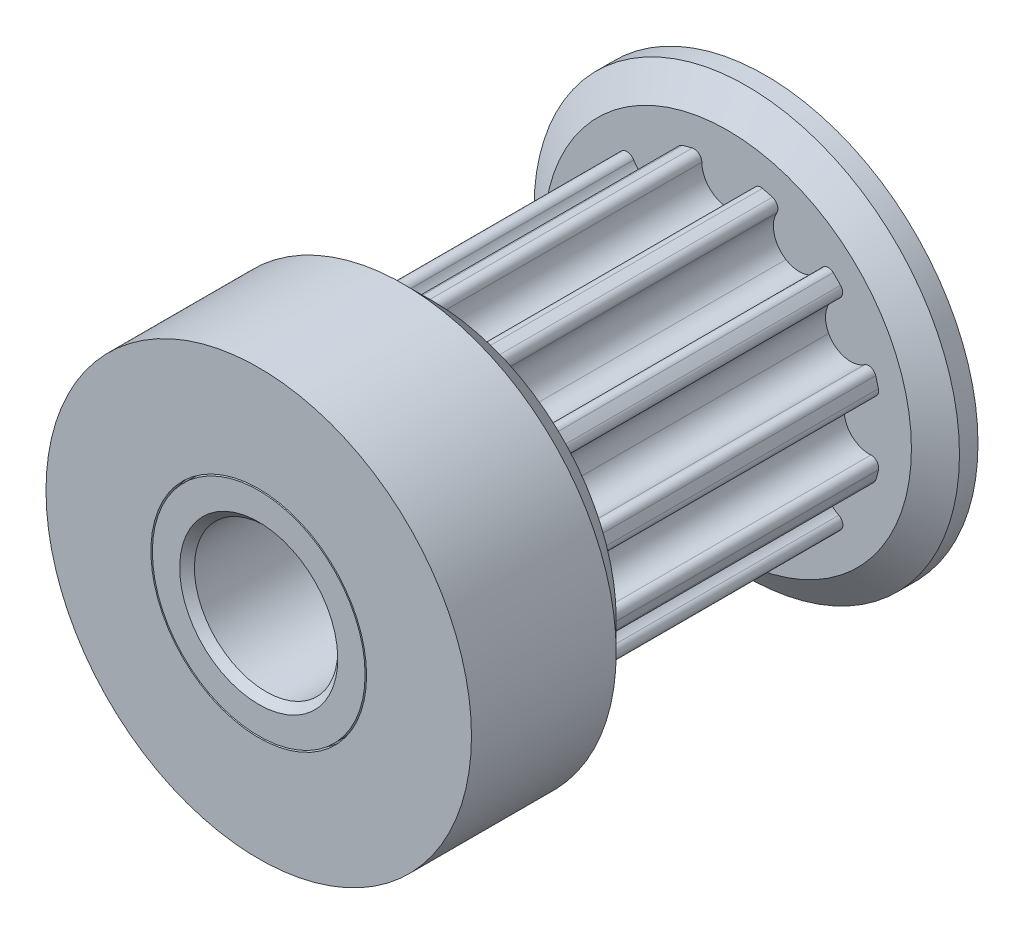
ISO-10303-21;
HEADER;
FILE_DESCRIPTION(('STEP AP214'),'2;1');
FILE_NAME('part.step','',(''),(''),'','','');
FILE_SCHEMA(('AUTOMOTIVE_DESIGN { 1 0 10303 214 1 1 1 1 }'));
ENDSEC;
DATA;
#1=APPLICATION_CONTEXT('core data for automotive mechanical design processes');
#2=APPLICATION_PROTOCOL_DEFINITION('international standard','automotive_design',2000,#1);
#3=PRODUCT_CONTEXT('',#1,'mechanical');
#4=PRODUCT('Part','Part','',(#3));
#5=PRODUCT_RELATED_PRODUCT_CATEGORY('part','',(#4));
#6=PRODUCT_DEFINITION_FORMATION('','',#4);
#7=PRODUCT_DEFINITION_CONTEXT('part definition',#1,'design');
#8=PRODUCT_DEFINITION('design','',#6,#7);
#9=PRODUCT_DEFINITION_SHAPE('','',#8);
#10=(LENGTH_UNIT() NAMED_UNIT(*) SI_UNIT(.MILLI.,.METRE.));
#11=(NAMED_UNIT(*) PLANE_ANGLE_UNIT() SI_UNIT($,.RADIAN.));
#12=(NAMED_UNIT(*) SI_UNIT($,.STERADIAN.) SOLID_ANGLE_UNIT());
#13=UNCERTAINTY_MEASURE_WITH_UNIT(LENGTH_MEASURE(1.E-05),#10,'distance_accuracy_value','');
#14=(GEOMETRIC_REPRESENTATION_CONTEXT(3) GLOBAL_UNCERTAINTY_ASSIGNED_CONTEXT((#13)) GLOBAL_UNIT_ASSIGNED_CONTEXT((#10,
#11,#12)) REPRESENTATION_CONTEXT('',''));
#15=CARTESIAN_POINT('',(0.,0.,0.));
#16=DIRECTION('',(0.,0.,1.));
#17=DIRECTION('',(1.,0.,0.));
#18=AXIS2_PLACEMENT_3D('',#15,#16,#17);
#19=CARTESIAN_POINT('',(-2.472796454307,-4.222049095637,0.));
#20=DIRECTION('',(0.,0.,1.));
#21=DIRECTION('',(1.,0.,0.));
#22=AXIS2_PLACEMENT_3D('',#19,#20,#21);
#23=CYLINDRICAL_SURFACE('',#22,0.8636);
#24=DIRECTION('',(0.,0.,1.));
#25=VECTOR('',#24,1.);
#26=CARTESIAN_POINT('',(-3.24721345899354,-3.83984069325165,0.));
#27=LINE('',#26,#25);
#28=CARTESIAN_POINT('',(-3.24721345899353,-3.83984069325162,-10.2));
#29=VERTEX_POINT('',#28);
#30=CARTESIAN_POINT('',(-3.2472134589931,-3.83984069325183,0.));
#31=VERTEX_POINT('',#30);
#32=EDGE_CURVE('E407',#29,#31,#27,.T.);
#33=ORIENTED_EDGE('',*,*,#32,.F.);
#34=CARTESIAN_POINT('',(-2.472796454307,-4.222049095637,-10.2));
#35=DIRECTION('',(0.,0.,1.));
#36=DIRECTION('',(1.,0.,0.));
#37=AXIS2_PLACEMENT_3D('',#34,#35,#36);
#38=CIRCLE('',#37,0.8636);
#39=CARTESIAN_POINT('',(-2.0148690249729,-3.4898555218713,-10.2));
#40=VERTEX_POINT('',#39);
#41=EDGE_CURVE('E19',#40,#29,#38,.T.);
#42=ORIENTED_EDGE('',*,*,#41,.F.);
#43=DIRECTION('',(0.,0.,1.));
#44=VECTOR('',#43,1.);
#45=CARTESIAN_POINT('',(-2.01486902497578,-3.48985552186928,0.));
#46=LINE('',#45,#44);
#47=CARTESIAN_POINT('',(-2.0148690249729,-3.4898555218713,0.));
#48=VERTEX_POINT('',#47);
#49=EDGE_CURVE('E405',#40,#48,#46,.T.);
#50=ORIENTED_EDGE('',*,*,#49,.T.);
#51=CARTESIAN_POINT('',(-2.472796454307,-4.222049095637,0.));
#52=DIRECTION('',(0.,0.,1.));
#53=DIRECTION('',(1.,0.,0.));
#54=AXIS2_PLACEMENT_3D('',#51,#52,#53);
#55=CIRCLE('',#54,0.8636);
#56=EDGE_CURVE('E408',#31,#48,#55,.F.);
#57=ORIENTED_EDGE('',*,*,#56,.F.);
#58=EDGE_LOOP('',(#33,#42,#50,#57));
#59=FACE_BOUND('',#58,.T.);
#60=ADVANCED_FACE('F16',(#59),#23,.F.);
#61=CARTESIAN_POINT('',(-3.474983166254,-3.727426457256,0.));
#62=DIRECTION('',(0.,0.,1.));
#63=DIRECTION('',(1.,0.,0.));
#64=AXIS2_PLACEMENT_3D('',#61,#62,#63);
#65=CYLINDRICAL_SURFACE('',#64,0.254);
#66=ORIENTED_EDGE('',*,*,#32,.T.);
#67=CARTESIAN_POINT('',(-3.474983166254,-3.727426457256,0.));
#68=DIRECTION('',(0.,0.,1.));
#69=DIRECTION('',(1.,0.,0.));
#70=AXIS2_PLACEMENT_3D('',#67,#68,#69);
#71=CIRCLE('',#70,0.254);
#72=CARTESIAN_POINT('',(-3.64818680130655,-3.91321262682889,0.));
#73=VERTEX_POINT('',#72);
#74=EDGE_CURVE('E788',#31,#73,#71,.F.);
#75=ORIENTED_EDGE('',*,*,#74,.T.);
#76=DIRECTION('',(0.,0.,-1.));
#77=VECTOR('',#76,1.);
#78=CARTESIAN_POINT('',(-3.64818680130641,-3.91321262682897,6.));
#79=LINE('',#78,#77);
#80=CARTESIAN_POINT('',(-3.64818680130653,-3.91321262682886,-10.2));
#81=VERTEX_POINT('',#80);
#82=EDGE_CURVE('E785',#81,#73,#79,.F.);
#83=ORIENTED_EDGE('',*,*,#82,.F.);
#84=CARTESIAN_POINT('',(-3.474983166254,-3.727426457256,-10.2));
#85=DIRECTION('',(0.,0.,1.));
#86=DIRECTION('',(1.,0.,0.));
#87=AXIS2_PLACEMENT_3D('',#84,#85,#86);
#88=CIRCLE('',#87,0.254);
#89=EDGE_CURVE('E411',#81,#29,#88,.T.);
#90=ORIENTED_EDGE('',*,*,#89,.T.);
#91=EDGE_LOOP('',(#66,#75,#83,#90));
#92=FACE_BOUND('',#91,.T.);
#93=ADVANCED_FACE('F793',(#92),#65,.T.);
#94=CARTESIAN_POINT('',(-2.505304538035,-4.274027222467,0.));
#95=DIRECTION('',(0.,0.,1.));
#96=DIRECTION('',(1.,0.,0.));
#97=AXIS2_PLACEMENT_3D('',#94,#95,#96);
#98=CYLINDRICAL_SURFACE('',#97,0.9249066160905);
#99=CARTESIAN_POINT('',(-2.505304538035,-4.274027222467,-10.2));
#100=DIRECTION('',(0.,0.,1.));
#101=DIRECTION('',(1.,0.,0.));
#102=AXIS2_PLACEMENT_3D('',#99,#100,#101);
#103=CIRCLE('',#102,0.9249066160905);
#104=CARTESIAN_POINT('',(-1.70179285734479,-4.73208969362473,-10.2));
#105=VERTEX_POINT('',#104);
#106=EDGE_CURVE('E389',#105,#40,#103,.T.);
#107=ORIENTED_EDGE('',*,*,#106,.F.);
#108=DIRECTION('',(0.,0.,1.));
#109=VECTOR('',#108,1.);
#110=CARTESIAN_POINT('',(-1.7017928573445,-4.73208969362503,0.));
#111=LINE('',#110,#109);
#112=CARTESIAN_POINT('',(-1.70179285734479,-4.73208969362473,0.));
#113=VERTEX_POINT('',#112);
#114=EDGE_CURVE('E782',#113,#105,#111,.F.);
#115=ORIENTED_EDGE('',*,*,#114,.F.);
#116=CARTESIAN_POINT('',(-2.505304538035,-4.274027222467,0.));
#117=DIRECTION('',(0.,0.,1.));
#118=DIRECTION('',(1.,0.,0.));
#119=AXIS2_PLACEMENT_3D('',#116,#117,#118);
#120=CIRCLE('',#119,0.9249066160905);
#121=EDGE_CURVE('E401',#48,#113,#120,.F.);
#122=ORIENTED_EDGE('',*,*,#121,.F.);
#123=ORIENTED_EDGE('',*,*,#49,.F.);
#124=EDGE_LOOP('',(#107,#115,#122,#123));
#125=FACE_BOUND('',#124,.T.);
#126=ADVANCED_FACE('F409',(#125),#98,.F.);
#127=CARTESIAN_POINT('',(0.,0.,6.));
#128=DIRECTION('',(0.,0.,-1.));
#129=DIRECTION('',(-1.,0.,0.));
#130=AXIS2_PLACEMENT_3D('',#127,#128,#129);
#131=CYLINDRICAL_SURFACE('',#130,5.35);
#132=ORIENTED_EDGE('',*,*,#82,.T.);
#133=CARTESIAN_POINT('',(0.,0.,0.));
#134=DIRECTION('',(0.,0.,-1.));
#135=DIRECTION('',(-1.,0.,0.));
#136=AXIS2_PLACEMENT_3D('',#133,#134,#135);
#137=CIRCLE('',#136,5.35);
#138=CARTESIAN_POINT('',(-3.89997931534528,-3.66233004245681,0.));
#139=VERTEX_POINT('',#138);
#140=EDGE_CURVE('E783',#73,#139,#137,.T.);
#141=ORIENTED_EDGE('',*,*,#140,.T.);
#142=DIRECTION('',(0.,0.,1.));
#143=VECTOR('',#142,1.);
#144=CARTESIAN_POINT('',(-3.89997931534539,-3.66233004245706,0.));
#145=LINE('',#144,#143);
#146=CARTESIAN_POINT('',(-3.89997931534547,-3.66233004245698,-10.2));
#147=VERTEX_POINT('',#146);
#148=EDGE_CURVE('E775',#147,#139,#145,.T.);
#149=ORIENTED_EDGE('',*,*,#148,.F.);
#150=CARTESIAN_POINT('',(0.,0.,-10.2));
#151=DIRECTION('',(0.,0.,-1.));
#152=DIRECTION('',(-1.,0.,0.));
#153=AXIS2_PLACEMENT_3D('',#150,#151,#152);
#154=CIRCLE('',#153,5.35);
#155=EDGE_CURVE('E400',#147,#81,#154,.F.);
#156=ORIENTED_EDGE('',*,*,#155,.T.);
#157=EDGE_LOOP('',(#132,#141,#149,#156));
#158=FACE_BOUND('',#157,.T.);
#159=ADVANCED_FACE('F801',(#158),#131,.T.);
#160=CARTESIAN_POINT('',(-1.468799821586,-4.864913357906,0.));
#161=DIRECTION('',(0.,0.,1.));
#162=DIRECTION('',(1.,0.,0.));
#163=AXIS2_PLACEMENT_3D('',#160,#161,#162);
#164=CYLINDRICAL_SURFACE('',#163,0.2681937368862);
#165=DIRECTION('',(0.,0.,-1.));
#166=VECTOR('',#165,1.);
#167=CARTESIAN_POINT('',(-1.5463161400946,-5.12166051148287,6.));
#168=LINE('',#167,#166);
#169=CARTESIAN_POINT('',(-1.54631614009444,-5.12166051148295,0.));
#170=VERTEX_POINT('',#169);
#171=CARTESIAN_POINT('',(-1.54631614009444,-5.12166051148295,-10.2));
#172=VERTEX_POINT('',#171);
#173=EDGE_CURVE('E771',#170,#172,#168,.T.);
#174=ORIENTED_EDGE('',*,*,#173,.F.);
#175=CARTESIAN_POINT('',(-1.468799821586,-4.864913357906,0.));
#176=DIRECTION('',(0.,0.,1.));
#177=DIRECTION('',(1.,0.,0.));
#178=AXIS2_PLACEMENT_3D('',#175,#176,#177);
#179=CIRCLE('',#178,0.2681937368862);
#180=EDGE_CURVE('E778',#170,#113,#179,.F.);
#181=ORIENTED_EDGE('',*,*,#180,.T.);
#182=ORIENTED_EDGE('',*,*,#114,.T.);
#183=CARTESIAN_POINT('',(-1.468799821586,-4.864913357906,-10.2));
#184=DIRECTION('',(0.,0.,1.));
#185=DIRECTION('',(1.,0.,0.));
#186=AXIS2_PLACEMENT_3D('',#183,#184,#185);
#187=CIRCLE('',#186,0.2681937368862);
#188=EDGE_CURVE('E395',#105,#172,#187,.T.);
#189=ORIENTED_EDGE('',*,*,#188,.T.);
#190=EDGE_LOOP('',(#174,#181,#182,#189));
#191=FACE_BOUND('',#190,.T.);
#192=ADVANCED_FACE('F814',(#191),#164,.T.);
#193=CARTESIAN_POINT('',(-3.704474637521,-3.478738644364,0.));
#194=DIRECTION('',(0.,0.,1.));
#195=DIRECTION('',(1.,0.,0.));
#196=AXIS2_PLACEMENT_3D('',#193,#194,#195);
#197=CYLINDRICAL_SURFACE('',#196,0.2681937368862);
#198=ORIENTED_EDGE('',*,*,#148,.T.);
#199=CARTESIAN_POINT('',(-3.704474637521,-3.478738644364,0.));
#200=DIRECTION('',(0.,0.,1.));
#201=DIRECTION('',(1.,0.,0.));
#202=AXIS2_PLACEMENT_3D('',#199,#200,#201);
#203=CIRCLE('',#202,0.2681937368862);
#204=CARTESIAN_POINT('',(-3.83984069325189,-3.24721345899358,0.));
#205=VERTEX_POINT('',#204);
#206=EDGE_CURVE('E772',#139,#205,#203,.F.);
#207=ORIENTED_EDGE('',*,*,#206,.T.);
#208=DIRECTION('',(0.,0.,1.));
#209=VECTOR('',#208,1.);
#210=CARTESIAN_POINT('',(-3.83984069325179,-3.24721345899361,0.));
#211=LINE('',#210,#209);
#212=CARTESIAN_POINT('',(-3.83984069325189,-3.24721345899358,-10.2));
#213=VERTEX_POINT('',#212);
#214=EDGE_CURVE('E767',#205,#213,#211,.F.);
#215=ORIENTED_EDGE('',*,*,#214,.T.);
#216=CARTESIAN_POINT('',(-3.704474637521,-3.478738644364,-10.2));
#217=DIRECTION('',(0.,0.,1.));
#218=DIRECTION('',(1.,0.,0.));
#219=AXIS2_PLACEMENT_3D('',#216,#217,#218);
#220=CIRCLE('',#219,0.2681937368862);
#221=EDGE_CURVE('E776',#213,#147,#220,.T.);
#222=ORIENTED_EDGE('',*,*,#221,.T.);
#223=EDGE_LOOP('',(#198,#207,#215,#222));
#224=FACE_BOUND('',#223,.T.);
#225=ADVANCED_FACE('F803',(#224),#197,.T.);
#226=CARTESIAN_POINT('',(0.,0.,6.));
#227=DIRECTION('',(0.,0.,-1.));
#228=DIRECTION('',(-1.,0.,0.));
#229=AXIS2_PLACEMENT_3D('',#226,#227,#228);
#230=CYLINDRICAL_SURFACE('',#229,5.35);
#231=DIRECTION('',(0.,0.,1.));
#232=VECTOR('',#231,1.);
#233=CARTESIAN_POINT('',(-1.20281613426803,-5.2130349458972,0.));
#234=LINE('',#233,#232);
#235=CARTESIAN_POINT('',(-1.20281613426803,-5.2130349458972,0.));
#236=VERTEX_POINT('',#235);
#237=CARTESIAN_POINT('',(-1.20281613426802,-5.21303494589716,-10.2));
#238=VERTEX_POINT('',#237);
#239=EDGE_CURVE('E763',#236,#238,#234,.F.);
#240=ORIENTED_EDGE('',*,*,#239,.F.);
#241=CARTESIAN_POINT('',(0.,0.,0.));
#242=DIRECTION('',(0.,0.,-1.));
#243=DIRECTION('',(-1.,0.,0.));
#244=AXIS2_PLACEMENT_3D('',#241,#242,#243);
#245=CIRCLE('',#244,5.35);
#246=EDGE_CURVE('E764',#236,#170,#245,.T.);
#247=ORIENTED_EDGE('',*,*,#246,.T.);
#248=ORIENTED_EDGE('',*,*,#173,.T.);
#249=CARTESIAN_POINT('',(0.,0.,-10.2));
#250=DIRECTION('',(0.,0.,-1.));
#251=DIRECTION('',(-1.,0.,0.));
#252=AXIS2_PLACEMENT_3D('',#249,#250,#251);
#253=CIRCLE('',#252,5.35);
#254=EDGE_CURVE('E768',#172,#238,#253,.F.);
#255=ORIENTED_EDGE('',*,*,#254,.T.);
#256=EDGE_LOOP('',(#240,#247,#248,#255));
#257=FACE_BOUND('',#256,.T.);
#258=ADVANCED_FACE('F819',(#257),#230,.T.);
#259=CARTESIAN_POINT('',(-4.306670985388,-2.448763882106,0.));
#260=DIRECTION('',(0.,0.,1.));
#261=DIRECTION('',(1.,0.,0.));
#262=AXIS2_PLACEMENT_3D('',#259,#260,#261);
#263=CYLINDRICAL_SURFACE('',#262,0.9249066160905);
#264=CARTESIAN_POINT('',(-4.306670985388,-2.448763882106,-10.2));
#265=DIRECTION('',(0.,0.,1.));
#266=DIRECTION('',(1.,0.,0.));
#267=AXIS2_PLACEMENT_3D('',#264,#265,#266);
#268=CIRCLE('',#267,0.9249066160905);
#269=CARTESIAN_POINT('',(-3.48985552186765,-2.01486902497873,-10.2));
#270=VERTEX_POINT('',#269);
#271=EDGE_CURVE('E759',#213,#270,#268,.T.);
#272=ORIENTED_EDGE('',*,*,#271,.F.);
#273=ORIENTED_EDGE('',*,*,#214,.F.);
#274=CARTESIAN_POINT('',(-4.306670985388,-2.448763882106,0.));
#275=DIRECTION('',(0.,0.,1.));
#276=DIRECTION('',(1.,0.,0.));
#277=AXIS2_PLACEMENT_3D('',#274,#275,#276);
#278=CIRCLE('',#277,0.9249066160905);
#279=CARTESIAN_POINT('',(-3.48985552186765,-2.01486902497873,0.));
#280=VERTEX_POINT('',#279);
#281=EDGE_CURVE('E761',#280,#205,#278,.F.);
#282=ORIENTED_EDGE('',*,*,#281,.F.);
#283=DIRECTION('',(0.,0.,1.));
#284=VECTOR('',#283,1.);
#285=CARTESIAN_POINT('',(-3.48985552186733,-2.01486902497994,0.));
#286=LINE('',#285,#284);
#287=EDGE_CURVE('E754',#280,#270,#286,.F.);
#288=ORIENTED_EDGE('',*,*,#287,.T.);
#289=EDGE_LOOP('',(#272,#273,#282,#288));
#290=FACE_BOUND('',#289,.T.);
#291=ADVANCED_FACE('F1220',(#290),#263,.F.);
#292=CARTESIAN_POINT('',(-1.145710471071,-4.965537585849,0.));
#293=DIRECTION('',(0.,0.,1.));
#294=DIRECTION('',(1.,0.,0.));
#295=AXIS2_PLACEMENT_3D('',#292,#293,#294);
#296=CYLINDRICAL_SURFACE('',#295,0.254);
#297=DIRECTION('',(0.,0.,1.));
#298=VECTOR('',#297,1.);
#299=CARTESIAN_POINT('',(-0.892249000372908,-4.94900631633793,0.));
#300=LINE('',#299,#298);
#301=CARTESIAN_POINT('',(-0.892249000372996,-4.9490063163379,-10.2));
#302=VERTEX_POINT('',#301);
#303=CARTESIAN_POINT('',(-0.892249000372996,-4.9490063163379,0.));
#304=VERTEX_POINT('',#303);
#305=EDGE_CURVE('E744',#302,#304,#300,.T.);
#306=ORIENTED_EDGE('',*,*,#305,.T.);
#307=CARTESIAN_POINT('',(-1.145710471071,-4.965537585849,0.));
#308=DIRECTION('',(0.,0.,1.));
#309=DIRECTION('',(1.,0.,0.));
#310=AXIS2_PLACEMENT_3D('',#307,#308,#309);
#311=CIRCLE('',#310,0.254);
#312=EDGE_CURVE('E755',#304,#236,#311,.F.);
#313=ORIENTED_EDGE('',*,*,#312,.T.);
#314=ORIENTED_EDGE('',*,*,#239,.T.);
#315=CARTESIAN_POINT('',(-1.145710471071,-4.965537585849,-10.2));
#316=DIRECTION('',(0.,0.,1.));
#317=DIRECTION('',(1.,0.,0.));
#318=AXIS2_PLACEMENT_3D('',#315,#316,#317);
#319=CIRCLE('',#318,0.254);
#320=EDGE_CURVE('E757',#238,#302,#319,.T.);
#321=ORIENTED_EDGE('',*,*,#320,.T.);
#322=EDGE_LOOP('',(#306,#313,#314,#321));
#323=FACE_BOUND('',#322,.T.);
#324=ADVANCED_FACE('F1216',(#323),#296,.T.);
#325=CARTESIAN_POINT('',(-4.252529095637,-2.420003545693,0.));
#326=DIRECTION('',(0.,0.,1.));
#327=DIRECTION('',(1.,0.,0.));
#328=AXIS2_PLACEMENT_3D('',#325,#326,#327);
#329=CYLINDRICAL_SURFACE('',#328,0.8636);
#330=DIRECTION('',(0.,0.,1.));
#331=VECTOR('',#330,1.);
#332=CARTESIAN_POINT('',(-4.73208969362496,-1.70179285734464,0.));
#333=LINE('',#332,#331);
#334=CARTESIAN_POINT('',(-4.73208969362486,-1.70179285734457,-10.2));
#335=VERTEX_POINT('',#334);
#336=CARTESIAN_POINT('',(-4.73208969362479,-1.70179285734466,0.));
#337=VERTEX_POINT('',#336);
#338=EDGE_CURVE('E739',#335,#337,#333,.T.);
#339=ORIENTED_EDGE('',*,*,#338,.F.);
#340=CARTESIAN_POINT('',(-4.252529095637,-2.420003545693,-10.2));
#341=DIRECTION('',(0.,0.,1.));
#342=DIRECTION('',(1.,0.,0.));
#343=AXIS2_PLACEMENT_3D('',#340,#341,#342);
#344=CIRCLE('',#343,0.8636);
#345=EDGE_CURVE('E751',#270,#335,#344,.T.);
#346=ORIENTED_EDGE('',*,*,#345,.F.);
#347=ORIENTED_EDGE('',*,*,#287,.F.);
#348=CARTESIAN_POINT('',(-4.252529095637,-2.420003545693,0.));
#349=DIRECTION('',(0.,0.,1.));
#350=DIRECTION('',(1.,0.,0.));
#351=AXIS2_PLACEMENT_3D('',#348,#349,#350);
#352=CIRCLE('',#351,0.8636);
#353=EDGE_CURVE('E748',#337,#280,#352,.F.);
#354=ORIENTED_EDGE('',*,*,#353,.F.);
#355=EDGE_LOOP('',(#339,#346,#347,#354));
#356=FACE_BOUND('',#355,.T.);
#357=ADVANCED_FACE('F1212',(#356),#329,.F.);
#358=CARTESIAN_POINT('',(-0.03048,-4.8928,0.));
#359=DIRECTION('',(0.,0.,1.));
#360=DIRECTION('',(1.,0.,0.));
#361=AXIS2_PLACEMENT_3D('',#358,#359,#360);
#362=CYLINDRICAL_SURFACE('',#361,0.8636);
#363=ORIENTED_EDGE('',*,*,#305,.F.);
#364=CARTESIAN_POINT('',(-0.03048,-4.8928,-10.2));
#365=DIRECTION('',(0.,0.,1.));
#366=DIRECTION('',(1.,0.,0.));
#367=AXIS2_PLACEMENT_3D('',#364,#365,#366);
#368=CIRCLE('',#367,0.8636);
#369=CARTESIAN_POINT('',(1.08714984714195E-13,-4.02973804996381,-10.2));
#370=VERTEX_POINT('',#369);
#371=EDGE_CURVE('E745',#370,#302,#368,.T.);
#372=ORIENTED_EDGE('',*,*,#371,.F.);
#373=DIRECTION('',(0.,0.,1.));
#374=VECTOR('',#373,1.);
#375=CARTESIAN_POINT('',(0.,-4.02973804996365,0.));
#376=LINE('',#375,#374);
#377=CARTESIAN_POINT('',(1.08714984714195E-13,-4.02973804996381,0.));
#378=VERTEX_POINT('',#377);
#379=EDGE_CURVE('E733',#370,#378,#376,.T.);
#380=ORIENTED_EDGE('',*,*,#379,.T.);
#381=CARTESIAN_POINT('',(-0.03048,-4.8928,0.));
#382=DIRECTION('',(0.,0.,1.));
#383=DIRECTION('',(1.,0.,0.));
#384=AXIS2_PLACEMENT_3D('',#381,#382,#383);
#385=CIRCLE('',#384,0.8636);
#386=EDGE_CURVE('E742',#304,#378,#385,.F.);
#387=ORIENTED_EDGE('',*,*,#386,.F.);
#388=EDGE_LOOP('',(#363,#372,#380,#387));
#389=FACE_BOUND('',#388,.T.);
#390=ADVANCED_FACE('F1208',(#389),#362,.F.);
#391=CARTESIAN_POINT('',(-4.873136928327,-1.490554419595,0.));
#392=DIRECTION('',(0.,0.,1.));
#393=DIRECTION('',(1.,0.,0.));
#394=AXIS2_PLACEMENT_3D('',#391,#392,#393);
#395=CYLINDRICAL_SURFACE('',#394,0.254);
#396=ORIENTED_EDGE('',*,*,#338,.T.);
#397=CARTESIAN_POINT('',(-4.873136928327,-1.490554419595,0.));
#398=DIRECTION('',(0.,0.,1.));
#399=DIRECTION('',(1.,0.,0.));
#400=AXIS2_PLACEMENT_3D('',#397,#398,#399);
#401=CIRCLE('',#400,0.254);
#402=CARTESIAN_POINT('',(-5.11602876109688,-1.56484814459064,0.));
#403=VERTEX_POINT('',#402);
#404=EDGE_CURVE('E737',#337,#403,#401,.F.);
#405=ORIENTED_EDGE('',*,*,#404,.T.);
#406=DIRECTION('',(0.,0.,-1.));
#407=VECTOR('',#406,1.);
#408=CARTESIAN_POINT('',(-5.11602876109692,-1.56484814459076,6.));
#409=LINE('',#408,#407);
#410=CARTESIAN_POINT('',(-5.11602876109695,-1.56484814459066,-10.2));
#411=VERTEX_POINT('',#410);
#412=EDGE_CURVE('E728',#411,#403,#409,.F.);
#413=ORIENTED_EDGE('',*,*,#412,.F.);
#414=CARTESIAN_POINT('',(-4.873136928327,-1.490554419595,-10.2));
#415=DIRECTION('',(0.,0.,1.));
#416=DIRECTION('',(1.,0.,0.));
#417=AXIS2_PLACEMENT_3D('',#414,#415,#416);
#418=CIRCLE('',#417,0.254);
#419=EDGE_CURVE('E740',#411,#335,#418,.T.);
#420=ORIENTED_EDGE('',*,*,#419,.T.);
#421=EDGE_LOOP('',(#396,#405,#413,#420));
#422=FACE_BOUND('',#421,.T.);
#423=ADVANCED_FACE('F1204',(#422),#395,.T.);
#424=CARTESIAN_POINT('',(-0.03264376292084,-4.95406842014,0.));
#425=DIRECTION('',(0.,0.,1.));
#426=DIRECTION('',(1.,0.,0.));
#427=AXIS2_PLACEMENT_3D('',#424,#425,#426);
#428=CYLINDRICAL_SURFACE('',#427,0.9249066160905);
#429=ORIENTED_EDGE('',*,*,#379,.F.);
#430=CARTESIAN_POINT('',(-0.03264376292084,-4.95406842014,-10.2));
#431=DIRECTION('',(0.,0.,1.));
#432=DIRECTION('',(1.,0.,0.));
#433=AXIS2_PLACEMENT_3D('',#430,#431,#432);
#434=CIRCLE('',#433,0.9249066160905);
#435=CARTESIAN_POINT('',(0.892249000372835,-4.94900631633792,-10.2));
#436=VERTEX_POINT('',#435);
#437=EDGE_CURVE('E734',#436,#370,#434,.T.);
#438=ORIENTED_EDGE('',*,*,#437,.F.);
#439=DIRECTION('',(0.,0.,1.));
#440=VECTOR('',#439,1.);
#441=CARTESIAN_POINT('',(0.892249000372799,-4.94900631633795,0.));
#442=LINE('',#441,#440);
#443=CARTESIAN_POINT('',(0.892249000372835,-4.94900631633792,0.));
#444=VERTEX_POINT('',#443);
#445=EDGE_CURVE('E725',#444,#436,#442,.F.);
#446=ORIENTED_EDGE('',*,*,#445,.F.);
#447=CARTESIAN_POINT('',(-0.03264376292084,-4.95406842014,0.));
#448=DIRECTION('',(0.,0.,1.));
#449=DIRECTION('',(1.,0.,0.));
#450=AXIS2_PLACEMENT_3D('',#447,#448,#449);
#451=CIRCLE('',#450,0.9249066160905);
#452=EDGE_CURVE('E731',#378,#444,#451,.F.);
#453=ORIENTED_EDGE('',*,*,#452,.F.);
#454=EDGE_LOOP('',(#429,#438,#446,#453));
#455=FACE_BOUND('',#454,.T.);
#456=ADVANCED_FACE('F1200',(#455),#428,.F.);
#457=CARTESIAN_POINT('',(0.,0.,6.));
#458=DIRECTION('',(0.,0.,-1.));
#459=DIRECTION('',(-1.,0.,0.));
#460=AXIS2_PLACEMENT_3D('',#457,#458,#459);
#461=CYLINDRICAL_SURFACE('',#460,5.35);
#462=ORIENTED_EDGE('',*,*,#412,.T.);
#463=CARTESIAN_POINT('',(0.,0.,0.));
#464=DIRECTION('',(0.,0.,-1.));
#465=DIRECTION('',(-1.,0.,0.));
#466=AXIS2_PLACEMENT_3D('',#463,#464,#465);
#467=CIRCLE('',#466,5.35);
#468=CARTESIAN_POINT('',(-5.20864618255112,-1.22168119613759,0.));
#469=VERTEX_POINT('',#468);
#470=EDGE_CURVE('E726',#403,#469,#467,.T.);
#471=ORIENTED_EDGE('',*,*,#470,.T.);
#472=DIRECTION('',(0.,0.,1.));
#473=VECTOR('',#472,1.);
#474=CARTESIAN_POINT('',(-5.20864618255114,-1.22168119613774,0.));
#475=LINE('',#474,#473);
#476=CARTESIAN_POINT('',(-5.20864618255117,-1.22168119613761,-10.2));
#477=VERTEX_POINT('',#476);
#478=EDGE_CURVE('E717',#477,#469,#475,.T.);
#479=ORIENTED_EDGE('',*,*,#478,.F.);
#480=CARTESIAN_POINT('',(0.,0.,-10.2));
#481=DIRECTION('',(0.,0.,-1.));
#482=DIRECTION('',(-1.,0.,0.));
#483=AXIS2_PLACEMENT_3D('',#480,#481,#482);
#484=CIRCLE('',#483,5.35);
#485=EDGE_CURVE('E729',#477,#411,#484,.F.);
#486=ORIENTED_EDGE('',*,*,#485,.T.);
#487=EDGE_LOOP('',(#462,#471,#479,#486));
#488=FACE_BOUND('',#487,.T.);
#489=ADVANCED_FACE('F1196',(#488),#461,.T.);
#490=CARTESIAN_POINT('',(1.160438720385,-4.94753846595,0.));
#491=DIRECTION('',(0.,0.,1.));
#492=DIRECTION('',(1.,0.,0.));
#493=AXIS2_PLACEMENT_3D('',#490,#491,#492);
#494=CYLINDRICAL_SURFACE('',#493,0.2681937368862);
#495=DIRECTION('',(0.,0.,-1.));
#496=VECTOR('',#495,1.);
#497=CARTESIAN_POINT('',(1.22168119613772,-5.20864618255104,6.));
#498=LINE('',#497,#496);
#499=CARTESIAN_POINT('',(1.2216811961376,-5.20864618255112,0.));
#500=VERTEX_POINT('',#499);
#501=CARTESIAN_POINT('',(1.2216811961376,-5.20864618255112,-10.2));
#502=VERTEX_POINT('',#501);
#503=EDGE_CURVE('E714',#500,#502,#498,.T.);
#504=ORIENTED_EDGE('',*,*,#503,.F.);
#505=CARTESIAN_POINT('',(1.160438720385,-4.94753846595,0.));
#506=DIRECTION('',(0.,0.,1.));
#507=DIRECTION('',(1.,0.,0.));
#508=AXIS2_PLACEMENT_3D('',#505,#506,#507);
#509=CIRCLE('',#508,0.2681937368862);
#510=EDGE_CURVE('E720',#500,#444,#509,.F.);
#511=ORIENTED_EDGE('',*,*,#510,.T.);
#512=ORIENTED_EDGE('',*,*,#445,.T.);
#513=CARTESIAN_POINT('',(1.160438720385,-4.94753846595,-10.2));
#514=DIRECTION('',(0.,0.,1.));
#515=DIRECTION('',(1.,0.,0.));
#516=AXIS2_PLACEMENT_3D('',#513,#514,#515);
#517=CIRCLE('',#516,0.2681937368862);
#518=EDGE_CURVE('E723',#436,#502,#517,.T.);
#519=ORIENTED_EDGE('',*,*,#518,.T.);
#520=EDGE_LOOP('',(#504,#511,#512,#519));
#521=FACE_BOUND('',#520,.T.);
#522=ADVANCED_FACE('F1192',(#521),#494,.T.);
#523=CARTESIAN_POINT('',(-4.94753846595,-1.160438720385,0.));
#524=DIRECTION('',(0.,0.,1.));
#525=DIRECTION('',(1.,0.,0.));
#526=AXIS2_PLACEMENT_3D('',#523,#524,#525);
#527=CYLINDRICAL_SURFACE('',#526,0.2681937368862);
#528=ORIENTED_EDGE('',*,*,#478,.T.);
#529=CARTESIAN_POINT('',(-4.94753846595,-1.160438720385,0.));
#530=DIRECTION('',(0.,0.,1.));
#531=DIRECTION('',(1.,0.,0.));
#532=AXIS2_PLACEMENT_3D('',#529,#530,#531);
#533=CIRCLE('',#532,0.2681937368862);
#534=CARTESIAN_POINT('',(-4.94900631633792,-0.892249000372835,0.));
#535=VERTEX_POINT('',#534);
#536=EDGE_CURVE('E715',#469,#535,#533,.F.);
#537=ORIENTED_EDGE('',*,*,#536,.T.);
#538=DIRECTION('',(0.,0.,1.));
#539=VECTOR('',#538,1.);
#540=CARTESIAN_POINT('',(-4.94900631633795,-0.892249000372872,0.));
#541=LINE('',#540,#539);
#542=CARTESIAN_POINT('',(-4.94900631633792,-0.892249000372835,-10.2));
#543=VERTEX_POINT('',#542);
#544=EDGE_CURVE('E707',#535,#543,#541,.F.);
#545=ORIENTED_EDGE('',*,*,#544,.T.);
#546=CARTESIAN_POINT('',(-4.94753846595,-1.160438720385,-10.2));
#547=DIRECTION('',(0.,0.,1.));
#548=DIRECTION('',(1.,0.,0.));
#549=AXIS2_PLACEMENT_3D('',#546,#547,#548);
#550=CIRCLE('',#549,0.2681937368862);
#551=EDGE_CURVE('E718',#543,#477,#550,.T.);
#552=ORIENTED_EDGE('',*,*,#551,.T.);
#553=EDGE_LOOP('',(#528,#537,#545,#552));
#554=FACE_BOUND('',#553,.T.);
#555=ADVANCED_FACE('F1188',(#554),#527,.T.);
#556=CARTESIAN_POINT('',(0.,0.,6.));
#557=DIRECTION('',(0.,0.,-1.));
#558=DIRECTION('',(-1.,0.,0.));
#559=AXIS2_PLACEMENT_3D('',#556,#557,#558);
#560=CYLINDRICAL_SURFACE('',#559,5.35);
#561=DIRECTION('',(0.,0.,1.));
#562=VECTOR('',#561,1.);
#563=CARTESIAN_POINT('',(1.56484814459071,-5.11602876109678,0.));
#564=LINE('',#563,#562);
#565=CARTESIAN_POINT('',(1.56484814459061,-5.11602876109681,0.));
#566=VERTEX_POINT('',#565);
#567=CARTESIAN_POINT('',(1.56484814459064,-5.11602876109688,-10.2));
#568=VERTEX_POINT('',#567);
#569=EDGE_CURVE('E703',#566,#568,#564,.F.);
#570=ORIENTED_EDGE('',*,*,#569,.F.);
#571=CARTESIAN_POINT('',(0.,0.,0.));
#572=DIRECTION('',(0.,0.,-1.));
#573=DIRECTION('',(-1.,0.,0.));
#574=AXIS2_PLACEMENT_3D('',#571,#572,#573);
#575=CIRCLE('',#574,5.35);
#576=EDGE_CURVE('E708',#566,#500,#575,.T.);
#577=ORIENTED_EDGE('',*,*,#576,.T.);
#578=ORIENTED_EDGE('',*,*,#503,.T.);
#579=CARTESIAN_POINT('',(0.,0.,-10.2));
#580=DIRECTION('',(0.,0.,-1.));
#581=DIRECTION('',(-1.,0.,0.));
#582=AXIS2_PLACEMENT_3D('',#579,#580,#581);
#583=CIRCLE('',#582,5.35);
#584=EDGE_CURVE('E711',#502,#568,#583,.F.);
#585=ORIENTED_EDGE('',*,*,#584,.T.);
#586=EDGE_LOOP('',(#570,#577,#578,#585));
#587=FACE_BOUND('',#586,.T.);
#588=ADVANCED_FACE('F1184',(#587),#560,.T.);
#589=CARTESIAN_POINT('',(-4.95406842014,0.03264376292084,0.));
#590=DIRECTION('',(0.,0.,1.));
#591=DIRECTION('',(1.,0.,0.));
#592=AXIS2_PLACEMENT_3D('',#589,#590,#591);
#593=CYLINDRICAL_SURFACE('',#592,0.9249066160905);
#594=DIRECTION('',(0.,0.,1.));
#595=VECTOR('',#594,1.);
#596=CARTESIAN_POINT('',(-4.02973804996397,0.,0.));
#597=LINE('',#596,#595);
#598=CARTESIAN_POINT('',(-4.02973804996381,-1.08709902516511E-13,0.));
#599=VERTEX_POINT('',#598);
#600=CARTESIAN_POINT('',(-4.02973804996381,-1.08709902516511E-13,-10.2));
#601=VERTEX_POINT('',#600);
#602=EDGE_CURVE('E699',#599,#601,#597,.F.);
#603=ORIENTED_EDGE('',*,*,#602,.T.);
#604=CARTESIAN_POINT('',(-4.95406842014,0.03264376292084,-10.2));
#605=DIRECTION('',(0.,0.,1.));
#606=DIRECTION('',(1.,0.,0.));
#607=AXIS2_PLACEMENT_3D('',#604,#605,#606);
#608=CIRCLE('',#607,0.9249066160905);
#609=EDGE_CURVE('E704',#543,#601,#608,.T.);
#610=ORIENTED_EDGE('',*,*,#609,.F.);
#611=ORIENTED_EDGE('',*,*,#544,.F.);
#612=CARTESIAN_POINT('',(-4.95406842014,0.03264376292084,0.));
#613=DIRECTION('',(0.,0.,1.));
#614=DIRECTION('',(1.,0.,0.));
#615=AXIS2_PLACEMENT_3D('',#612,#613,#614);
#616=CIRCLE('',#615,0.9249066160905);
#617=EDGE_CURVE('E700',#599,#535,#616,.F.);
#618=ORIENTED_EDGE('',*,*,#617,.F.);
#619=EDGE_LOOP('',(#603,#610,#611,#618));
#620=FACE_BOUND('',#619,.T.);
#621=ADVANCED_FACE('F1180',(#620),#593,.F.);
#622=CARTESIAN_POINT('',(1.490554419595,-4.873136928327,0.));
#623=DIRECTION('',(0.,0.,1.));
#624=DIRECTION('',(1.,0.,0.));
#625=AXIS2_PLACEMENT_3D('',#622,#623,#624);
#626=CYLINDRICAL_SURFACE('',#625,0.254);
#627=DIRECTION('',(0.,0.,1.));
#628=VECTOR('',#627,1.);
#629=CARTESIAN_POINT('',(1.70179285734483,-4.73208969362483,0.));
#630=LINE('',#629,#628);
#631=CARTESIAN_POINT('',(1.70179285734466,-4.73208969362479,-10.2));
#632=VERTEX_POINT('',#631);
#633=CARTESIAN_POINT('',(1.70179285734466,-4.73208969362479,0.));
#634=VERTEX_POINT('',#633);
#635=EDGE_CURVE('E686',#632,#634,#630,.T.);
#636=ORIENTED_EDGE('',*,*,#635,.T.);
#637=CARTESIAN_POINT('',(1.490554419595,-4.873136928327,0.));
#638=DIRECTION('',(0.,0.,1.));
#639=DIRECTION('',(1.,0.,0.));
#640=AXIS2_PLACEMENT_3D('',#637,#638,#639);
#641=CIRCLE('',#640,0.254);
#642=EDGE_CURVE('E695',#634,#566,#641,.F.);
#643=ORIENTED_EDGE('',*,*,#642,.T.);
#644=ORIENTED_EDGE('',*,*,#569,.T.);
#645=CARTESIAN_POINT('',(1.490554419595,-4.873136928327,-10.2));
#646=DIRECTION('',(0.,0.,1.));
#647=DIRECTION('',(1.,0.,0.));
#648=AXIS2_PLACEMENT_3D('',#645,#646,#647);
#649=CIRCLE('',#648,0.254);
#650=EDGE_CURVE('E697',#568,#632,#649,.T.);
#651=ORIENTED_EDGE('',*,*,#650,.T.);
#652=EDGE_LOOP('',(#636,#643,#644,#651));
#653=FACE_BOUND('',#652,.T.);
#654=ADVANCED_FACE('F1176',(#653),#626,.T.);
#655=CARTESIAN_POINT('',(-4.8928,0.03048,0.));
#656=DIRECTION('',(0.,0.,1.));
#657=DIRECTION('',(1.,0.,0.));
#658=AXIS2_PLACEMENT_3D('',#655,#656,#657);
#659=CYLINDRICAL_SURFACE('',#658,0.8636);
#660=CARTESIAN_POINT('',(-4.8928,0.03048,-10.2));
#661=DIRECTION('',(0.,0.,1.));
#662=DIRECTION('',(1.,0.,0.));
#663=AXIS2_PLACEMENT_3D('',#660,#661,#662);
#664=CIRCLE('',#663,0.8636);
#665=CARTESIAN_POINT('',(-4.9490063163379,0.892249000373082,-10.2));
#666=VERTEX_POINT('',#665);
#667=EDGE_CURVE('E690',#601,#666,#664,.T.);
#668=ORIENTED_EDGE('',*,*,#667,.F.);
#669=ORIENTED_EDGE('',*,*,#602,.F.);
#670=CARTESIAN_POINT('',(-4.8928,0.03048,0.));
#671=DIRECTION('',(0.,0.,1.));
#672=DIRECTION('',(1.,0.,0.));
#673=AXIS2_PLACEMENT_3D('',#670,#671,#672);
#674=CIRCLE('',#673,0.8636);
#675=CARTESIAN_POINT('',(-4.9490063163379,0.892249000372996,0.));
#676=VERTEX_POINT('',#675);
#677=EDGE_CURVE('E693',#676,#599,#674,.F.);
#678=ORIENTED_EDGE('',*,*,#677,.F.);
#679=DIRECTION('',(0.,0.,1.));
#680=VECTOR('',#679,1.);
#681=CARTESIAN_POINT('',(-4.94900631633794,0.89224900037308,0.));
#682=LINE('',#681,#680);
#683=EDGE_CURVE('E681',#666,#676,#682,.T.);
#684=ORIENTED_EDGE('',*,*,#683,.F.);
#685=EDGE_LOOP('',(#668,#669,#678,#684));
#686=FACE_BOUND('',#685,.T.);
#687=ADVANCED_FACE('F1172',(#686),#659,.F.);
#688=CARTESIAN_POINT('',(2.420003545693,-4.252529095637,0.));
#689=DIRECTION('',(0.,0.,1.));
#690=DIRECTION('',(1.,0.,0.));
#691=AXIS2_PLACEMENT_3D('',#688,#689,#690);
#692=CYLINDRICAL_SURFACE('',#691,0.8636);
#693=ORIENTED_EDGE('',*,*,#635,.F.);
#694=CARTESIAN_POINT('',(2.420003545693,-4.252529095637,-10.2));
#695=DIRECTION('',(0.,0.,1.));
#696=DIRECTION('',(1.,0.,0.));
#697=AXIS2_PLACEMENT_3D('',#694,#695,#696);
#698=CIRCLE('',#697,0.8636);
#699=CARTESIAN_POINT('',(2.01486902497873,-3.48985552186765,-10.2));
#700=VERTEX_POINT('',#699);
#701=EDGE_CURVE('E687',#700,#632,#698,.T.);
#702=ORIENTED_EDGE('',*,*,#701,.F.);
#703=DIRECTION('',(0.,0.,1.));
#704=VECTOR('',#703,1.);
#705=CARTESIAN_POINT('',(2.01486902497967,-3.48985552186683,0.));
#706=LINE('',#705,#704);
#707=CARTESIAN_POINT('',(2.01486902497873,-3.48985552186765,0.));
#708=VERTEX_POINT('',#707);
#709=EDGE_CURVE('E675',#700,#708,#706,.T.);
#710=ORIENTED_EDGE('',*,*,#709,.T.);
#711=CARTESIAN_POINT('',(2.420003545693,-4.252529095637,0.));
#712=DIRECTION('',(0.,0.,1.));
#713=DIRECTION('',(1.,0.,0.));
#714=AXIS2_PLACEMENT_3D('',#711,#712,#713);
#715=CIRCLE('',#714,0.8636);
#716=EDGE_CURVE('E684',#634,#708,#715,.F.);
#717=ORIENTED_EDGE('',*,*,#716,.F.);
#718=EDGE_LOOP('',(#693,#702,#710,#717));
#719=FACE_BOUND('',#718,.T.);
#720=ADVANCED_FACE('F1168',(#719),#692,.F.);
#721=CARTESIAN_POINT('',(-4.965537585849,1.145710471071,0.));
#722=DIRECTION('',(0.,0.,1.));
#723=DIRECTION('',(1.,0.,0.));
#724=AXIS2_PLACEMENT_3D('',#721,#722,#723);
#725=CYLINDRICAL_SURFACE('',#724,0.254);
#726=ORIENTED_EDGE('',*,*,#683,.T.);
#727=CARTESIAN_POINT('',(-4.965537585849,1.145710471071,0.));
#728=DIRECTION('',(0.,0.,1.));
#729=DIRECTION('',(1.,0.,0.));
#730=AXIS2_PLACEMENT_3D('',#727,#728,#729);
#731=CIRCLE('',#730,0.254);
#732=CARTESIAN_POINT('',(-5.21303494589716,1.20281613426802,0.));
#733=VERTEX_POINT('',#732);
#734=EDGE_CURVE('E679',#676,#733,#731,.F.);
#735=ORIENTED_EDGE('',*,*,#734,.T.);
#736=DIRECTION('',(0.,0.,-1.));
#737=VECTOR('',#736,1.);
#738=CARTESIAN_POINT('',(-5.21303494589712,1.20281613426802,6.));
#739=LINE('',#738,#737);
#740=CARTESIAN_POINT('',(-5.21303494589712,1.20281613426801,-10.2));
#741=VERTEX_POINT('',#740);
#742=EDGE_CURVE('E670',#741,#733,#739,.F.);
#743=ORIENTED_EDGE('',*,*,#742,.F.);
#744=CARTESIAN_POINT('',(-4.965537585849,1.145710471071,-10.2));
#745=DIRECTION('',(0.,0.,1.));
#746=DIRECTION('',(1.,0.,0.));
#747=AXIS2_PLACEMENT_3D('',#744,#745,#746);
#748=CIRCLE('',#747,0.254);
#749=EDGE_CURVE('E682',#741,#666,#748,.T.);
#750=ORIENTED_EDGE('',*,*,#749,.T.);
#751=EDGE_LOOP('',(#726,#735,#743,#750));
#752=FACE_BOUND('',#751,.T.);
#753=ADVANCED_FACE('F1164',(#752),#725,.T.);
#754=CARTESIAN_POINT('',(2.448763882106,-4.306670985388,0.));
#755=DIRECTION('',(0.,0.,1.));
#756=DIRECTION('',(1.,0.,0.));
#757=AXIS2_PLACEMENT_3D('',#754,#755,#756);
#758=CYLINDRICAL_SURFACE('',#757,0.9249066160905);
#759=ORIENTED_EDGE('',*,*,#709,.F.);
#760=CARTESIAN_POINT('',(2.448763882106,-4.306670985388,-10.2));
#761=DIRECTION('',(0.,0.,1.));
#762=DIRECTION('',(1.,0.,0.));
#763=AXIS2_PLACEMENT_3D('',#760,#761,#762);
#764=CIRCLE('',#763,0.9249066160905);
#765=CARTESIAN_POINT('',(3.24721345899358,-3.83984069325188,-10.2));
#766=VERTEX_POINT('',#765);
#767=EDGE_CURVE('E676',#766,#700,#764,.T.);
#768=ORIENTED_EDGE('',*,*,#767,.F.);
#769=DIRECTION('',(0.,0.,1.));
#770=VECTOR('',#769,1.);
#771=CARTESIAN_POINT('',(3.24721345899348,-3.83984069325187,0.));
#772=LINE('',#771,#770);
#773=CARTESIAN_POINT('',(3.24721345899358,-3.83984069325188,0.));
#774=VERTEX_POINT('',#773);
#775=EDGE_CURVE('E667',#774,#766,#772,.F.);
#776=ORIENTED_EDGE('',*,*,#775,.F.);
#777=CARTESIAN_POINT('',(2.448763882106,-4.306670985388,0.));
#778=DIRECTION('',(0.,0.,1.));
#779=DIRECTION('',(1.,0.,0.));
#780=AXIS2_PLACEMENT_3D('',#777,#778,#779);
#781=CIRCLE('',#780,0.9249066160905);
#782=EDGE_CURVE('E673',#708,#774,#781,.F.);
#783=ORIENTED_EDGE('',*,*,#782,.F.);
#784=EDGE_LOOP('',(#759,#768,#776,#783));
#785=FACE_BOUND('',#784,.T.);
#786=ADVANCED_FACE('F1160',(#785),#758,.F.);
#787=CARTESIAN_POINT('',(0.,0.,6.));
#788=DIRECTION('',(0.,0.,-1.));
#789=DIRECTION('',(-1.,0.,0.));
#790=AXIS2_PLACEMENT_3D('',#787,#788,#789);
#791=CYLINDRICAL_SURFACE('',#790,5.35);
#792=ORIENTED_EDGE('',*,*,#742,.T.);
#793=CARTESIAN_POINT('',(0.,0.,0.));
#794=DIRECTION('',(0.,0.,-1.));
#795=DIRECTION('',(-1.,0.,0.));
#796=AXIS2_PLACEMENT_3D('',#793,#794,#795);
#797=CIRCLE('',#796,5.35);
#798=CARTESIAN_POINT('',(-5.12166051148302,1.54631614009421,0.));
#799=VERTEX_POINT('',#798);
#800=EDGE_CURVE('E668',#733,#799,#797,.T.);
#801=ORIENTED_EDGE('',*,*,#800,.T.);
#802=DIRECTION('',(0.,0.,1.));
#803=VECTOR('',#802,1.);
#804=CARTESIAN_POINT('',(-5.12166051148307,1.54631614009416,0.));
#805=LINE('',#804,#803);
#806=CARTESIAN_POINT('',(-5.12166051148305,1.54631614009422,-10.2));
#807=VERTEX_POINT('',#806);
#808=EDGE_CURVE('E659',#807,#799,#805,.T.);
#809=ORIENTED_EDGE('',*,*,#808,.F.);
#810=CARTESIAN_POINT('',(0.,0.,-10.2));
#811=DIRECTION('',(0.,0.,-1.));
#812=DIRECTION('',(-1.,0.,0.));
#813=AXIS2_PLACEMENT_3D('',#810,#811,#812);
#814=CIRCLE('',#813,5.35);
#815=EDGE_CURVE('E671',#807,#741,#814,.F.);
#816=ORIENTED_EDGE('',*,*,#815,.T.);
#817=EDGE_LOOP('',(#792,#801,#809,#816));
#818=FACE_BOUND('',#817,.T.);
#819=ADVANCED_FACE('F1156',(#818),#791,.T.);
#820=CARTESIAN_POINT('',(3.478738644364,-3.704474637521,0.));
#821=DIRECTION('',(0.,0.,1.));
#822=DIRECTION('',(1.,0.,0.));
#823=AXIS2_PLACEMENT_3D('',#820,#821,#822);
#824=CYLINDRICAL_SURFACE('',#823,0.2681937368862);
#825=DIRECTION('',(0.,0.,-1.));
#826=VECTOR('',#825,1.);
#827=CARTESIAN_POINT('',(3.66233004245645,-3.89997931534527,6.));
#828=LINE('',#827,#826);
#829=CARTESIAN_POINT('',(3.66233004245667,-3.89997931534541,0.));
#830=VERTEX_POINT('',#829);
#831=CARTESIAN_POINT('',(3.66233004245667,-3.89997931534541,-10.2));
#832=VERTEX_POINT('',#831);
#833=EDGE_CURVE('E656',#830,#832,#828,.T.);
#834=ORIENTED_EDGE('',*,*,#833,.F.);
#835=CARTESIAN_POINT('',(3.478738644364,-3.704474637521,0.));
#836=DIRECTION('',(0.,0.,1.));
#837=DIRECTION('',(1.,0.,0.));
#838=AXIS2_PLACEMENT_3D('',#835,#836,#837);
#839=CIRCLE('',#838,0.2681937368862);
#840=EDGE_CURVE('E662',#830,#774,#839,.F.);
#841=ORIENTED_EDGE('',*,*,#840,.T.);
#842=ORIENTED_EDGE('',*,*,#775,.T.);
#843=CARTESIAN_POINT('',(3.478738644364,-3.704474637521,-10.2));
#844=DIRECTION('',(0.,0.,1.));
#845=DIRECTION('',(1.,0.,0.));
#846=AXIS2_PLACEMENT_3D('',#843,#844,#845);
#847=CIRCLE('',#846,0.2681937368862);
#848=EDGE_CURVE('E665',#766,#832,#847,.T.);
#849=ORIENTED_EDGE('',*,*,#848,.T.);
#850=EDGE_LOOP('',(#834,#841,#842,#849));
#851=FACE_BOUND('',#850,.T.);
#852=ADVANCED_FACE('F1152',(#851),#824,.T.);
#853=CARTESIAN_POINT('',(-4.864913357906,1.468799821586,0.));
#854=DIRECTION('',(0.,0.,1.));
#855=DIRECTION('',(1.,0.,0.));
#856=AXIS2_PLACEMENT_3D('',#853,#854,#855);
#857=CYLINDRICAL_SURFACE('',#856,0.2681937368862);
#858=ORIENTED_EDGE('',*,*,#808,.T.);
#859=CARTESIAN_POINT('',(-4.864913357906,1.468799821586,0.));
#860=DIRECTION('',(0.,0.,1.));
#861=DIRECTION('',(1.,0.,0.));
#862=AXIS2_PLACEMENT_3D('',#859,#860,#861);
#863=CIRCLE('',#862,0.2681937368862);
#864=CARTESIAN_POINT('',(-4.73208969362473,1.70179285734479,0.));
#865=VERTEX_POINT('',#864);
#866=EDGE_CURVE('E657',#799,#865,#863,.F.);
#867=ORIENTED_EDGE('',*,*,#866,.T.);
#868=DIRECTION('',(0.,0.,1.));
#869=VECTOR('',#868,1.);
#870=CARTESIAN_POINT('',(-4.73208969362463,1.7017928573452,0.));
#871=LINE('',#870,#869);
#872=CARTESIAN_POINT('',(-4.73208969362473,1.70179285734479,-10.2));
#873=VERTEX_POINT('',#872);
#874=EDGE_CURVE('E649',#865,#873,#871,.F.);
#875=ORIENTED_EDGE('',*,*,#874,.T.);
#876=CARTESIAN_POINT('',(-4.864913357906,1.468799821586,-10.2));
#877=DIRECTION('',(0.,0.,1.));
#878=DIRECTION('',(1.,0.,0.));
#879=AXIS2_PLACEMENT_3D('',#876,#877,#878);
#880=CIRCLE('',#879,0.2681937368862);
#881=EDGE_CURVE('E660',#873,#807,#880,.T.);
#882=ORIENTED_EDGE('',*,*,#881,.T.);
#883=EDGE_LOOP('',(#858,#867,#875,#882));
#884=FACE_BOUND('',#883,.T.);
#885=ADVANCED_FACE('F1148',(#884),#857,.T.);
#886=CARTESIAN_POINT('',(0.,0.,6.));
#887=DIRECTION('',(0.,0.,-1.));
#888=DIRECTION('',(-1.,0.,0.));
#889=AXIS2_PLACEMENT_3D('',#886,#887,#888);
#890=CYLINDRICAL_SURFACE('',#889,5.35);
#891=DIRECTION('',(0.,0.,1.));
#892=VECTOR('',#891,1.);
#893=CARTESIAN_POINT('',(3.91321262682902,-3.64818680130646,0.));
#894=LINE('',#893,#892);
#895=CARTESIAN_POINT('',(3.91321262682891,-3.64818680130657,0.));
#896=VERTEX_POINT('',#895);
#897=CARTESIAN_POINT('',(3.91321262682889,-3.64818680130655,-10.2));
#898=VERTEX_POINT('',#897);
#899=EDGE_CURVE('E645',#896,#898,#894,.F.);
#900=ORIENTED_EDGE('',*,*,#899,.F.);
#901=CARTESIAN_POINT('',(0.,0.,0.));
#902=DIRECTION('',(0.,0.,-1.));
#903=DIRECTION('',(-1.,0.,0.));
#904=AXIS2_PLACEMENT_3D('',#901,#902,#903);
#905=CIRCLE('',#904,5.35);
#906=EDGE_CURVE('E650',#896,#830,#905,.T.);
#907=ORIENTED_EDGE('',*,*,#906,.T.);
#908=ORIENTED_EDGE('',*,*,#833,.T.);
#909=CARTESIAN_POINT('',(0.,0.,-10.2));
#910=DIRECTION('',(0.,0.,-1.));
#911=DIRECTION('',(-1.,0.,0.));
#912=AXIS2_PLACEMENT_3D('',#909,#910,#911);
#913=CIRCLE('',#912,5.35);
#914=EDGE_CURVE('E653',#832,#898,#913,.F.);
#915=ORIENTED_EDGE('',*,*,#914,.T.);
#916=EDGE_LOOP('',(#900,#907,#908,#915));
#917=FACE_BOUND('',#916,.T.);
#918=ADVANCED_FACE('F1144',(#917),#890,.T.);
#919=CARTESIAN_POINT('',(-4.274027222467,2.505304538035,0.));
#920=DIRECTION('',(0.,0.,1.));
#921=DIRECTION('',(1.,0.,0.));
#922=AXIS2_PLACEMENT_3D('',#919,#920,#921);
#923=CYLINDRICAL_SURFACE('',#922,0.9249066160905);
#924=DIRECTION('',(0.,0.,1.));
#925=VECTOR('',#924,1.);
#926=CARTESIAN_POINT('',(-3.4898555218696,2.01486902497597,0.));
#927=LINE('',#926,#925);
#928=CARTESIAN_POINT('',(-3.4898555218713,2.0148690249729,0.));
#929=VERTEX_POINT('',#928);
#930=CARTESIAN_POINT('',(-3.4898555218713,2.0148690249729,-10.2));
#931=VERTEX_POINT('',#930);
#932=EDGE_CURVE('E641',#929,#931,#927,.F.);
#933=ORIENTED_EDGE('',*,*,#932,.T.);
#934=CARTESIAN_POINT('',(-4.274027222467,2.505304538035,-10.2));
#935=DIRECTION('',(0.,0.,1.));
#936=DIRECTION('',(1.,0.,0.));
#937=AXIS2_PLACEMENT_3D('',#934,#935,#936);
#938=CIRCLE('',#937,0.9249066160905);
#939=EDGE_CURVE('E646',#873,#931,#938,.T.);
#940=ORIENTED_EDGE('',*,*,#939,.F.);
#941=ORIENTED_EDGE('',*,*,#874,.F.);
#942=CARTESIAN_POINT('',(-4.274027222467,2.505304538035,0.));
#943=DIRECTION('',(0.,0.,1.));
#944=DIRECTION('',(1.,0.,0.));
#945=AXIS2_PLACEMENT_3D('',#942,#943,#944);
#946=CIRCLE('',#945,0.9249066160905);
#947=EDGE_CURVE('E642',#929,#865,#946,.F.);
#948=ORIENTED_EDGE('',*,*,#947,.F.);
#949=EDGE_LOOP('',(#933,#940,#941,#948));
#950=FACE_BOUND('',#949,.T.);
#951=ADVANCED_FACE('F1140',(#950),#923,.F.);
#952=CARTESIAN_POINT('',(3.727426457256,-3.474983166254,0.));
#953=DIRECTION('',(0.,0.,1.));
#954=DIRECTION('',(1.,0.,0.));
#955=AXIS2_PLACEMENT_3D('',#952,#953,#954);
#956=CYLINDRICAL_SURFACE('',#955,0.254);
#957=DIRECTION('',(0.,0.,1.));
#958=VECTOR('',#957,1.);
#959=CARTESIAN_POINT('',(3.83984069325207,-3.24721345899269,0.));
#960=LINE('',#959,#958);
#961=CARTESIAN_POINT('',(3.83984069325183,-3.2472134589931,-10.2));
#962=VERTEX_POINT('',#961);
#963=CARTESIAN_POINT('',(3.83984069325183,-3.2472134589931,0.));
#964=VERTEX_POINT('',#963);
#965=EDGE_CURVE('E628',#962,#964,#960,.T.);
#966=ORIENTED_EDGE('',*,*,#965,.T.);
#967=CARTESIAN_POINT('',(3.727426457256,-3.474983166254,0.));
#968=DIRECTION('',(0.,0.,1.));
#969=DIRECTION('',(1.,0.,0.));
#970=AXIS2_PLACEMENT_3D('',#967,#968,#969);
#971=CIRCLE('',#970,0.254);
#972=EDGE_CURVE('E637',#964,#896,#971,.F.);
#973=ORIENTED_EDGE('',*,*,#972,.T.);
#974=ORIENTED_EDGE('',*,*,#899,.T.);
#975=CARTESIAN_POINT('',(3.727426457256,-3.474983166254,-10.2));
#976=DIRECTION('',(0.,0.,1.));
#977=DIRECTION('',(1.,0.,0.));
#978=AXIS2_PLACEMENT_3D('',#975,#976,#977);
#979=CIRCLE('',#978,0.254);
#980=EDGE_CURVE('E639',#898,#962,#979,.T.);
#981=ORIENTED_EDGE('',*,*,#980,.T.);
#982=EDGE_LOOP('',(#966,#973,#974,#981));
#983=FACE_BOUND('',#982,.T.);
#984=ADVANCED_FACE('F1136',(#983),#956,.T.);
#985=CARTESIAN_POINT('',(-4.222049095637,2.472796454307,0.));
#986=DIRECTION('',(0.,0.,1.));
#987=DIRECTION('',(1.,0.,0.));
#988=AXIS2_PLACEMENT_3D('',#985,#986,#987);
#989=CYLINDRICAL_SURFACE('',#988,0.8636);
#990=CARTESIAN_POINT('',(-4.222049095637,2.472796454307,-10.2));
#991=DIRECTION('',(0.,0.,1.));
#992=DIRECTION('',(1.,0.,0.));
#993=AXIS2_PLACEMENT_3D('',#990,#991,#992);
#994=CIRCLE('',#993,0.8636);
#995=CARTESIAN_POINT('',(-3.83984069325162,3.24721345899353,-10.2));
#996=VERTEX_POINT('',#995);
#997=EDGE_CURVE('E632',#931,#996,#994,.T.);
#998=ORIENTED_EDGE('',*,*,#997,.F.);
#999=ORIENTED_EDGE('',*,*,#932,.F.);
#1000=CARTESIAN_POINT('',(-4.222049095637,2.472796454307,0.));
#1001=DIRECTION('',(0.,0.,1.));
#1002=DIRECTION('',(1.,0.,0.));
#1003=AXIS2_PLACEMENT_3D('',#1000,#1001,#1002);
#1004=CIRCLE('',#1003,0.8636);
#1005=CARTESIAN_POINT('',(-3.83984069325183,3.2472134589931,0.));
#1006=VERTEX_POINT('',#1005);
#1007=EDGE_CURVE('E635',#1006,#929,#1004,.F.);
#1008=ORIENTED_EDGE('',*,*,#1007,.F.);
#1009=DIRECTION('',(0.,0.,1.));
#1010=VECTOR('',#1009,1.);
#1011=CARTESIAN_POINT('',(-3.83984069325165,3.24721345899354,0.));
#1012=LINE('',#1011,#1010);
#1013=EDGE_CURVE('E623',#996,#1006,#1012,.T.);
#1014=ORIENTED_EDGE('',*,*,#1013,.F.);
#1015=EDGE_LOOP('',(#998,#999,#1008,#1014));
#1016=FACE_BOUND('',#1015,.T.);
#1017=ADVANCED_FACE('F1132',(#1016),#989,.F.);
#1018=CARTESIAN_POINT('',(4.222049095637,-2.472796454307,0.));
#1019=DIRECTION('',(0.,0.,1.));
#1020=DIRECTION('',(1.,0.,0.));
#1021=AXIS2_PLACEMENT_3D('',#1018,#1019,#1020);
#1022=CYLINDRICAL_SURFACE('',#1021,0.8636);
#1023=ORIENTED_EDGE('',*,*,#965,.F.);
#1024=CARTESIAN_POINT('',(4.222049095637,-2.472796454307,-10.2));
#1025=DIRECTION('',(0.,0.,1.));
#1026=DIRECTION('',(1.,0.,0.));
#1027=AXIS2_PLACEMENT_3D('',#1024,#1025,#1026);
#1028=CIRCLE('',#1027,0.8636);
#1029=CARTESIAN_POINT('',(3.4898555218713,-2.0148690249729,-10.2));
#1030=VERTEX_POINT('',#1029);
#1031=EDGE_CURVE('E629',#1030,#962,#1028,.T.);
#1032=ORIENTED_EDGE('',*,*,#1031,.F.);
#1033=DIRECTION('',(0.,0.,1.));
#1034=VECTOR('',#1033,1.);
#1035=CARTESIAN_POINT('',(3.48985552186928,-2.01486902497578,0.));
#1036=LINE('',#1035,#1034);
#1037=CARTESIAN_POINT('',(3.4898555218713,-2.0148690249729,0.));
#1038=VERTEX_POINT('',#1037);
#1039=EDGE_CURVE('E617',#1030,#1038,#1036,.T.);
#1040=ORIENTED_EDGE('',*,*,#1039,.T.);
#1041=CARTESIAN_POINT('',(4.222049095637,-2.472796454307,0.));
#1042=DIRECTION('',(0.,0.,1.));
#1043=DIRECTION('',(1.,0.,0.));
#1044=AXIS2_PLACEMENT_3D('',#1041,#1042,#1043);
#1045=CIRCLE('',#1044,0.8636);
#1046=EDGE_CURVE('E626',#964,#1038,#1045,.F.);
#1047=ORIENTED_EDGE('',*,*,#1046,.F.);
#1048=EDGE_LOOP('',(#1023,#1032,#1040,#1047));
#1049=FACE_BOUND('',#1048,.T.);
#1050=ADVANCED_FACE('F1128',(#1049),#1022,.F.);
#1051=CARTESIAN_POINT('',(-3.727426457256,3.474983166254,0.));
#1052=DIRECTION('',(0.,0.,1.));
#1053=DIRECTION('',(1.,0.,0.));
#1054=AXIS2_PLACEMENT_3D('',#1051,#1052,#1053);
#1055=CYLINDRICAL_SURFACE('',#1054,0.254);
#1056=ORIENTED_EDGE('',*,*,#1013,.T.);
#1057=CARTESIAN_POINT('',(-3.727426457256,3.474983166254,0.));
#1058=DIRECTION('',(0.,0.,1.));
#1059=DIRECTION('',(1.,0.,0.));
#1060=AXIS2_PLACEMENT_3D('',#1057,#1058,#1059);
#1061=CIRCLE('',#1060,0.254);
#1062=CARTESIAN_POINT('',(-3.91321262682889,3.64818680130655,0.));
#1063=VERTEX_POINT('',#1062);
#1064=EDGE_CURVE('E621',#1006,#1063,#1061,.F.);
#1065=ORIENTED_EDGE('',*,*,#1064,.T.);
#1066=DIRECTION('',(0.,0.,-1.));
#1067=VECTOR('',#1066,1.);
#1068=CARTESIAN_POINT('',(-3.91321262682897,3.64818680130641,6.));
#1069=LINE('',#1068,#1067);
#1070=CARTESIAN_POINT('',(-3.91321262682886,3.64818680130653,-10.2));
#1071=VERTEX_POINT('',#1070);
#1072=EDGE_CURVE('E612',#1071,#1063,#1069,.F.);
#1073=ORIENTED_EDGE('',*,*,#1072,.F.);
#1074=CARTESIAN_POINT('',(-3.727426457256,3.474983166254,-10.2));
#1075=DIRECTION('',(0.,0.,1.));
#1076=DIRECTION('',(1.,0.,0.));
#1077=AXIS2_PLACEMENT_3D('',#1074,#1075,#1076);
#1078=CIRCLE('',#1077,0.254);
#1079=EDGE_CURVE('E624',#1071,#996,#1078,.T.);
#1080=ORIENTED_EDGE('',*,*,#1079,.T.);
#1081=EDGE_LOOP('',(#1056,#1065,#1073,#1080));
#1082=FACE_BOUND('',#1081,.T.);
#1083=ADVANCED_FACE('F1124',(#1082),#1055,.T.);
#1084=CARTESIAN_POINT('',(4.274027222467,-2.505304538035,0.));
#1085=DIRECTION('',(0.,0.,1.));
#1086=DIRECTION('',(1.,0.,0.));
#1087=AXIS2_PLACEMENT_3D('',#1084,#1085,#1086);
#1088=CYLINDRICAL_SURFACE('',#1087,0.9249066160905);
#1089=ORIENTED_EDGE('',*,*,#1039,.F.);
#1090=CARTESIAN_POINT('',(4.274027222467,-2.505304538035,-10.2));
#1091=DIRECTION('',(0.,0.,1.));
#1092=DIRECTION('',(1.,0.,0.));
#1093=AXIS2_PLACEMENT_3D('',#1090,#1091,#1092);
#1094=CIRCLE('',#1093,0.9249066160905);
#1095=CARTESIAN_POINT('',(4.73208969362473,-1.70179285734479,-10.2));
#1096=VERTEX_POINT('',#1095);
#1097=EDGE_CURVE('E618',#1096,#1030,#1094,.T.);
#1098=ORIENTED_EDGE('',*,*,#1097,.F.);
#1099=DIRECTION('',(0.,0.,1.));
#1100=VECTOR('',#1099,1.);
#1101=CARTESIAN_POINT('',(4.73208969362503,-1.7017928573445,0.));
#1102=LINE('',#1101,#1100);
#1103=CARTESIAN_POINT('',(4.73208969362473,-1.70179285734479,0.));
#1104=VERTEX_POINT('',#1103);
#1105=EDGE_CURVE('E609',#1104,#1096,#1102,.F.);
#1106=ORIENTED_EDGE('',*,*,#1105,.F.);
#1107=CARTESIAN_POINT('',(4.274027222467,-2.505304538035,0.));
#1108=DIRECTION('',(0.,0.,1.));
#1109=DIRECTION('',(1.,0.,0.));
#1110=AXIS2_PLACEMENT_3D('',#1107,#1108,#1109);
#1111=CIRCLE('',#1110,0.9249066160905);
#1112=EDGE_CURVE('E615',#1038,#1104,#1111,.F.);
#1113=ORIENTED_EDGE('',*,*,#1112,.F.);
#1114=EDGE_LOOP('',(#1089,#1098,#1106,#1113));
#1115=FACE_BOUND('',#1114,.T.);
#1116=ADVANCED_FACE('F1120',(#1115),#1088,.F.);
#1117=CARTESIAN_POINT('',(0.,0.,6.));
#1118=DIRECTION('',(0.,0.,-1.));
#1119=DIRECTION('',(-1.,0.,0.));
#1120=AXIS2_PLACEMENT_3D('',#1117,#1118,#1119);
#1121=CYLINDRICAL_SURFACE('',#1120,5.35);
#1122=ORIENTED_EDGE('',*,*,#1072,.T.);
#1123=CARTESIAN_POINT('',(0.,0.,0.));
#1124=DIRECTION('',(0.,0.,-1.));
#1125=DIRECTION('',(-1.,0.,0.));
#1126=AXIS2_PLACEMENT_3D('',#1123,#1124,#1125);
#1127=CIRCLE('',#1126,5.35);
#1128=CARTESIAN_POINT('',(-3.66233004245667,3.89997931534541,0.));
#1129=VERTEX_POINT('',#1128);
#1130=EDGE_CURVE('E610',#1063,#1129,#1127,.T.);
#1131=ORIENTED_EDGE('',*,*,#1130,.T.);
#1132=DIRECTION('',(0.,0.,1.));
#1133=VECTOR('',#1132,1.);
#1134=CARTESIAN_POINT('',(-3.6623300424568,3.89997931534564,0.));
#1135=LINE('',#1134,#1133);
#1136=CARTESIAN_POINT('',(-3.66233004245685,3.89997931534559,-10.2));
#1137=VERTEX_POINT('',#1136);
#1138=EDGE_CURVE('E601',#1137,#1129,#1135,.T.);
#1139=ORIENTED_EDGE('',*,*,#1138,.F.);
#1140=CARTESIAN_POINT('',(0.,0.,-10.2));
#1141=DIRECTION('',(0.,0.,-1.));
#1142=DIRECTION('',(-1.,0.,0.));
#1143=AXIS2_PLACEMENT_3D('',#1140,#1141,#1142);
#1144=CIRCLE('',#1143,5.35);
#1145=EDGE_CURVE('E613',#1137,#1071,#1144,.F.);
#1146=ORIENTED_EDGE('',*,*,#1145,.T.);
#1147=EDGE_LOOP('',(#1122,#1131,#1139,#1146));
#1148=FACE_BOUND('',#1147,.T.);
#1149=ADVANCED_FACE('F1116',(#1148),#1121,.T.);
#1150=CARTESIAN_POINT('',(4.864913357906,-1.468799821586,0.));
#1151=DIRECTION('',(0.,0.,1.));
#1152=DIRECTION('',(1.,0.,0.));
#1153=AXIS2_PLACEMENT_3D('',#1150,#1151,#1152);
#1154=CYLINDRICAL_SURFACE('',#1153,0.2681937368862);
#1155=DIRECTION('',(0.,0.,-1.));
#1156=VECTOR('',#1155,1.);
#1157=CARTESIAN_POINT('',(5.12166051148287,-1.5463161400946,6.));
#1158=LINE('',#1157,#1156);
#1159=CARTESIAN_POINT('',(5.12166051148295,-1.54631614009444,0.));
#1160=VERTEX_POINT('',#1159);
#1161=CARTESIAN_POINT('',(5.12166051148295,-1.54631614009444,-10.2));
#1162=VERTEX_POINT('',#1161);
#1163=EDGE_CURVE('E598',#1160,#1162,#1158,.T.);
#1164=ORIENTED_EDGE('',*,*,#1163,.F.);
#1165=CARTESIAN_POINT('',(4.864913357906,-1.468799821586,0.));
#1166=DIRECTION('',(0.,0.,1.));
#1167=DIRECTION('',(1.,0.,0.));
#1168=AXIS2_PLACEMENT_3D('',#1165,#1166,#1167);
#1169=CIRCLE('',#1168,0.2681937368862);
#1170=EDGE_CURVE('E604',#1160,#1104,#1169,.F.);
#1171=ORIENTED_EDGE('',*,*,#1170,.T.);
#1172=ORIENTED_EDGE('',*,*,#1105,.T.);
#1173=CARTESIAN_POINT('',(4.864913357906,-1.468799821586,-10.2));
#1174=DIRECTION('',(0.,0.,1.));
#1175=DIRECTION('',(1.,0.,0.));
#1176=AXIS2_PLACEMENT_3D('',#1173,#1174,#1175);
#1177=CIRCLE('',#1176,0.2681937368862);
#1178=EDGE_CURVE('E607',#1096,#1162,#1177,.T.);
#1179=ORIENTED_EDGE('',*,*,#1178,.T.);
#1180=EDGE_LOOP('',(#1164,#1171,#1172,#1179));
#1181=FACE_BOUND('',#1180,.T.);
#1182=ADVANCED_FACE('F1112',(#1181),#1154,.T.);
#1183=CARTESIAN_POINT('',(-3.478738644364,3.704474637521,0.));
#1184=DIRECTION('',(0.,0.,1.));
#1185=DIRECTION('',(1.,0.,0.));
#1186=AXIS2_PLACEMENT_3D('',#1183,#1184,#1185);
#1187=CYLINDRICAL_SURFACE('',#1186,0.2681937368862);
#1188=ORIENTED_EDGE('',*,*,#1138,.T.);
#1189=CARTESIAN_POINT('',(-3.478738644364,3.704474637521,0.));
#1190=DIRECTION('',(0.,0.,1.));
#1191=DIRECTION('',(1.,0.,0.));
#1192=AXIS2_PLACEMENT_3D('',#1189,#1190,#1191);
#1193=CIRCLE('',#1192,0.2681937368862);
#1194=CARTESIAN_POINT('',(-3.24721345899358,3.83984069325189,0.));
#1195=VERTEX_POINT('',#1194);
#1196=EDGE_CURVE('E599',#1129,#1195,#1193,.F.);
#1197=ORIENTED_EDGE('',*,*,#1196,.T.);
#1198=DIRECTION('',(0.,0.,1.));
#1199=VECTOR('',#1198,1.);
#1200=CARTESIAN_POINT('',(-3.24721345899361,3.83984069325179,0.));
#1201=LINE('',#1200,#1199);
#1202=CARTESIAN_POINT('',(-3.24721345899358,3.83984069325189,-10.2));
#1203=VERTEX_POINT('',#1202);
#1204=EDGE_CURVE('E591',#1195,#1203,#1201,.F.);
#1205=ORIENTED_EDGE('',*,*,#1204,.T.);
#1206=CARTESIAN_POINT('',(-3.478738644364,3.704474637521,-10.2));
#1207=DIRECTION('',(0.,0.,1.));
#1208=DIRECTION('',(1.,0.,0.));
#1209=AXIS2_PLACEMENT_3D('',#1206,#1207,#1208);
#1210=CIRCLE('',#1209,0.2681937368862);
#1211=EDGE_CURVE('E602',#1203,#1137,#1210,.T.);
#1212=ORIENTED_EDGE('',*,*,#1211,.T.);
#1213=EDGE_LOOP('',(#1188,#1197,#1205,#1212));
#1214=FACE_BOUND('',#1213,.T.);
#1215=ADVANCED_FACE('F1108',(#1214),#1187,.T.);
#1216=CARTESIAN_POINT('',(0.,0.,6.));
#1217=DIRECTION('',(0.,0.,-1.));
#1218=DIRECTION('',(-1.,0.,0.));
#1219=AXIS2_PLACEMENT_3D('',#1216,#1217,#1218);
#1220=CYLINDRICAL_SURFACE('',#1219,5.35);
#1221=DIRECTION('',(0.,0.,1.));
#1222=VECTOR('',#1221,1.);
#1223=CARTESIAN_POINT('',(5.2130349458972,-1.20281613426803,0.));
#1224=LINE('',#1223,#1222);
#1225=CARTESIAN_POINT('',(5.2130349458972,-1.20281613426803,0.));
#1226=VERTEX_POINT('',#1225);
#1227=CARTESIAN_POINT('',(5.21303494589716,-1.20281613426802,-10.2));
#1228=VERTEX_POINT('',#1227);
#1229=EDGE_CURVE('E587',#1226,#1228,#1224,.F.);
#1230=ORIENTED_EDGE('',*,*,#1229,.F.);
#1231=CARTESIAN_POINT('',(0.,0.,0.));
#1232=DIRECTION('',(0.,0.,-1.));
#1233=DIRECTION('',(-1.,0.,0.));
#1234=AXIS2_PLACEMENT_3D('',#1231,#1232,#1233);
#1235=CIRCLE('',#1234,5.35);
#1236=EDGE_CURVE('E592',#1226,#1160,#1235,.T.);
#1237=ORIENTED_EDGE('',*,*,#1236,.T.);
#1238=ORIENTED_EDGE('',*,*,#1163,.T.);
#1239=CARTESIAN_POINT('',(0.,0.,-10.2));
#1240=DIRECTION('',(0.,0.,-1.));
#1241=DIRECTION('',(-1.,0.,0.));
#1242=AXIS2_PLACEMENT_3D('',#1239,#1240,#1241);
#1243=CIRCLE('',#1242,5.35);
#1244=EDGE_CURVE('E595',#1162,#1228,#1243,.F.);
#1245=ORIENTED_EDGE('',*,*,#1244,.T.);
#1246=EDGE_LOOP('',(#1230,#1237,#1238,#1245));
#1247=FACE_BOUND('',#1246,.T.);
#1248=ADVANCED_FACE('F1104',(#1247),#1220,.T.);
#1249=CARTESIAN_POINT('',(-2.448763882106,4.306670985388,0.));
#1250=DIRECTION('',(0.,0.,1.));
#1251=DIRECTION('',(1.,0.,0.));
#1252=AXIS2_PLACEMENT_3D('',#1249,#1250,#1251);
#1253=CYLINDRICAL_SURFACE('',#1252,0.9249066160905);
#1254=DIRECTION('',(0.,0.,1.));
#1255=VECTOR('',#1254,1.);
#1256=CARTESIAN_POINT('',(-2.01486902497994,3.48985552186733,0.));
#1257=LINE('',#1256,#1255);
#1258=CARTESIAN_POINT('',(-2.01486902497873,3.48985552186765,0.));
#1259=VERTEX_POINT('',#1258);
#1260=CARTESIAN_POINT('',(-2.01486902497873,3.48985552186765,-10.2));
#1261=VERTEX_POINT('',#1260);
#1262=EDGE_CURVE('E583',#1259,#1261,#1257,.F.);
#1263=ORIENTED_EDGE('',*,*,#1262,.T.);
#1264=CARTESIAN_POINT('',(-2.448763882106,4.306670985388,-10.2));
#1265=DIRECTION('',(0.,0.,1.));
#1266=DIRECTION('',(1.,0.,0.));
#1267=AXIS2_PLACEMENT_3D('',#1264,#1265,#1266);
#1268=CIRCLE('',#1267,0.9249066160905);
#1269=EDGE_CURVE('E588',#1203,#1261,#1268,.T.);
#1270=ORIENTED_EDGE('',*,*,#1269,.F.);
#1271=ORIENTED_EDGE('',*,*,#1204,.F.);
#1272=CARTESIAN_POINT('',(-2.448763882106,4.306670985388,0.));
#1273=DIRECTION('',(0.,0.,1.));
#1274=DIRECTION('',(1.,0.,0.));
#1275=AXIS2_PLACEMENT_3D('',#1272,#1273,#1274);
#1276=CIRCLE('',#1275,0.9249066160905);
#1277=EDGE_CURVE('E584',#1259,#1195,#1276,.F.);
#1278=ORIENTED_EDGE('',*,*,#1277,.F.);
#1279=EDGE_LOOP('',(#1263,#1270,#1271,#1278));
#1280=FACE_BOUND('',#1279,.T.);
#1281=ADVANCED_FACE('F1100',(#1280),#1253,.F.);
#1282=CARTESIAN_POINT('',(4.965537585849,-1.145710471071,0.));
#1283=DIRECTION('',(0.,0.,1.));
#1284=DIRECTION('',(1.,0.,0.));
#1285=AXIS2_PLACEMENT_3D('',#1282,#1283,#1284);
#1286=CYLINDRICAL_SURFACE('',#1285,0.254);
#1287=DIRECTION('',(0.,0.,1.));
#1288=VECTOR('',#1287,1.);
#1289=CARTESIAN_POINT('',(4.94900631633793,-0.892249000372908,0.));
#1290=LINE('',#1289,#1288);
#1291=CARTESIAN_POINT('',(4.9490063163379,-0.892249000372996,-10.2));
#1292=VERTEX_POINT('',#1291);
#1293=CARTESIAN_POINT('',(4.9490063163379,-0.892249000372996,0.));
#1294=VERTEX_POINT('',#1293);
#1295=EDGE_CURVE('E570',#1292,#1294,#1290,.T.);
#1296=ORIENTED_EDGE('',*,*,#1295,.T.);
#1297=CARTESIAN_POINT('',(4.965537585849,-1.145710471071,0.));
#1298=DIRECTION('',(0.,0.,1.));
#1299=DIRECTION('',(1.,0.,0.));
#1300=AXIS2_PLACEMENT_3D('',#1297,#1298,#1299);
#1301=CIRCLE('',#1300,0.254);
#1302=EDGE_CURVE('E579',#1294,#1226,#1301,.F.);
#1303=ORIENTED_EDGE('',*,*,#1302,.T.);
#1304=ORIENTED_EDGE('',*,*,#1229,.T.);
#1305=CARTESIAN_POINT('',(4.965537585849,-1.145710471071,-10.2));
#1306=DIRECTION('',(0.,0.,1.));
#1307=DIRECTION('',(1.,0.,0.));
#1308=AXIS2_PLACEMENT_3D('',#1305,#1306,#1307);
#1309=CIRCLE('',#1308,0.254);
#1310=EDGE_CURVE('E581',#1228,#1292,#1309,.T.);
#1311=ORIENTED_EDGE('',*,*,#1310,.T.);
#1312=EDGE_LOOP('',(#1296,#1303,#1304,#1311));
#1313=FACE_BOUND('',#1312,.T.);
#1314=ADVANCED_FACE('F1096',(#1313),#1286,.T.);
#1315=CARTESIAN_POINT('',(-2.420003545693,4.252529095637,0.));
#1316=DIRECTION('',(0.,0.,1.));
#1317=DIRECTION('',(1.,0.,0.));
#1318=AXIS2_PLACEMENT_3D('',#1315,#1316,#1317);
#1319=CYLINDRICAL_SURFACE('',#1318,0.8636);
#1320=CARTESIAN_POINT('',(-2.420003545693,4.252529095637,-10.2));
#1321=DIRECTION('',(0.,0.,1.));
#1322=DIRECTION('',(1.,0.,0.));
#1323=AXIS2_PLACEMENT_3D('',#1320,#1321,#1322);
#1324=CIRCLE('',#1323,0.8636);
#1325=CARTESIAN_POINT('',(-1.70179285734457,4.73208969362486,-10.2));
#1326=VERTEX_POINT('',#1325);
#1327=EDGE_CURVE('E574',#1261,#1326,#1324,.T.);
#1328=ORIENTED_EDGE('',*,*,#1327,.F.);
#1329=ORIENTED_EDGE('',*,*,#1262,.F.);
#1330=CARTESIAN_POINT('',(-2.420003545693,4.252529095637,0.));
#1331=DIRECTION('',(0.,0.,1.));
#1332=DIRECTION('',(1.,0.,0.));
#1333=AXIS2_PLACEMENT_3D('',#1330,#1331,#1332);
#1334=CIRCLE('',#1333,0.8636);
#1335=CARTESIAN_POINT('',(-1.70179285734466,4.73208969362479,0.));
#1336=VERTEX_POINT('',#1335);
#1337=EDGE_CURVE('E577',#1336,#1259,#1334,.F.);
#1338=ORIENTED_EDGE('',*,*,#1337,.F.);
#1339=DIRECTION('',(0.,0.,1.));
#1340=VECTOR('',#1339,1.);
#1341=CARTESIAN_POINT('',(-1.70179285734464,4.73208969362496,0.));
#1342=LINE('',#1341,#1340);
#1343=EDGE_CURVE('E565',#1326,#1336,#1342,.T.);
#1344=ORIENTED_EDGE('',*,*,#1343,.F.);
#1345=EDGE_LOOP('',(#1328,#1329,#1338,#1344));
#1346=FACE_BOUND('',#1345,.T.);
#1347=ADVANCED_FACE('F1092',(#1346),#1319,.F.);
#1348=CARTESIAN_POINT('',(4.8928,-0.03048,0.));
#1349=DIRECTION('',(0.,0.,1.));
#1350=DIRECTION('',(1.,0.,0.));
#1351=AXIS2_PLACEMENT_3D('',#1348,#1349,#1350);
#1352=CYLINDRICAL_SURFACE('',#1351,0.8636);
#1353=ORIENTED_EDGE('',*,*,#1295,.F.);
#1354=CARTESIAN_POINT('',(4.8928,-0.03048,-10.2));
#1355=DIRECTION('',(0.,0.,1.));
#1356=DIRECTION('',(1.,0.,0.));
#1357=AXIS2_PLACEMENT_3D('',#1354,#1355,#1356);
#1358=CIRCLE('',#1357,0.8636);
#1359=CARTESIAN_POINT('',(4.02973804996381,1.11520357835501E-13,-10.2));
#1360=VERTEX_POINT('',#1359);
#1361=EDGE_CURVE('E571',#1360,#1292,#1358,.T.);
#1362=ORIENTED_EDGE('',*,*,#1361,.F.);
#1363=DIRECTION('',(0.,0.,1.));
#1364=VECTOR('',#1363,1.);
#1365=CARTESIAN_POINT('',(4.02973804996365,0.,0.));
#1366=LINE('',#1365,#1364);
#1367=CARTESIAN_POINT('',(4.02973804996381,1.11520357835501E-13,0.));
#1368=VERTEX_POINT('',#1367);
#1369=EDGE_CURVE('E559',#1360,#1368,#1366,.T.);
#1370=ORIENTED_EDGE('',*,*,#1369,.T.);
#1371=CARTESIAN_POINT('',(4.8928,-0.03048,0.));
#1372=DIRECTION('',(0.,0.,1.));
#1373=DIRECTION('',(1.,0.,0.));
#1374=AXIS2_PLACEMENT_3D('',#1371,#1372,#1373);
#1375=CIRCLE('',#1374,0.8636);
#1376=EDGE_CURVE('E568',#1294,#1368,#1375,.F.);
#1377=ORIENTED_EDGE('',*,*,#1376,.F.);
#1378=EDGE_LOOP('',(#1353,#1362,#1370,#1377));
#1379=FACE_BOUND('',#1378,.T.);
#1380=ADVANCED_FACE('F1088',(#1379),#1352,.F.);
#1381=CARTESIAN_POINT('',(-1.490554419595,4.873136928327,0.));
#1382=DIRECTION('',(0.,0.,1.));
#1383=DIRECTION('',(1.,0.,0.));
#1384=AXIS2_PLACEMENT_3D('',#1381,#1382,#1383);
#1385=CYLINDRICAL_SURFACE('',#1384,0.254);
#1386=ORIENTED_EDGE('',*,*,#1343,.T.);
#1387=CARTESIAN_POINT('',(-1.490554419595,4.873136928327,0.));
#1388=DIRECTION('',(0.,0.,1.));
#1389=DIRECTION('',(1.,0.,0.));
#1390=AXIS2_PLACEMENT_3D('',#1387,#1388,#1389);
#1391=CIRCLE('',#1390,0.254);
#1392=CARTESIAN_POINT('',(-1.56484814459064,5.11602876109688,0.));
#1393=VERTEX_POINT('',#1392);
#1394=EDGE_CURVE('E563',#1336,#1393,#1391,.F.);
#1395=ORIENTED_EDGE('',*,*,#1394,.T.);
#1396=DIRECTION('',(0.,0.,-1.));
#1397=VECTOR('',#1396,1.);
#1398=CARTESIAN_POINT('',(-1.56484814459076,5.11602876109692,6.));
#1399=LINE('',#1398,#1397);
#1400=CARTESIAN_POINT('',(-1.56484814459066,5.11602876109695,-10.2));
#1401=VERTEX_POINT('',#1400);
#1402=EDGE_CURVE('E553',#1401,#1393,#1399,.F.);
#1403=ORIENTED_EDGE('',*,*,#1402,.F.);
#1404=CARTESIAN_POINT('',(-1.490554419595,4.873136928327,-10.2));
#1405=DIRECTION('',(0.,0.,1.));
#1406=DIRECTION('',(1.,0.,0.));
#1407=AXIS2_PLACEMENT_3D('',#1404,#1405,#1406);
#1408=CIRCLE('',#1407,0.254);
#1409=EDGE_CURVE('E566',#1401,#1326,#1408,.T.);
#1410=ORIENTED_EDGE('',*,*,#1409,.T.);
#1411=EDGE_LOOP('',(#1386,#1395,#1403,#1410));
#1412=FACE_BOUND('',#1411,.T.);
#1413=ADVANCED_FACE('F1084',(#1412),#1385,.T.);
#1414=CARTESIAN_POINT('',(4.95406842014,-0.03264376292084,0.));
#1415=DIRECTION('',(0.,0.,1.));
#1416=DIRECTION('',(1.,0.,0.));
#1417=AXIS2_PLACEMENT_3D('',#1414,#1415,#1416);
#1418=CYLINDRICAL_SURFACE('',#1417,0.9249066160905);
#1419=ORIENTED_EDGE('',*,*,#1369,.F.);
#1420=CARTESIAN_POINT('',(4.95406842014,-0.03264376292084,-10.2));
#1421=DIRECTION('',(0.,0.,1.));
#1422=DIRECTION('',(1.,0.,0.));
#1423=AXIS2_PLACEMENT_3D('',#1420,#1421,#1422);
#1424=CIRCLE('',#1423,0.9249066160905);
#1425=CARTESIAN_POINT('',(4.94900631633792,0.892249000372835,-10.2));
#1426=VERTEX_POINT('',#1425);
#1427=EDGE_CURVE('E560',#1426,#1360,#1424,.T.);
#1428=ORIENTED_EDGE('',*,*,#1427,.F.);
#1429=DIRECTION('',(0.,0.,1.));
#1430=VECTOR('',#1429,1.);
#1431=CARTESIAN_POINT('',(4.94900631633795,0.892249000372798,0.));
#1432=LINE('',#1431,#1430);
#1433=CARTESIAN_POINT('',(4.94900631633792,0.892249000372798,0.));
#1434=VERTEX_POINT('',#1433);
#1435=EDGE_CURVE('E550',#1434,#1426,#1432,.F.);
#1436=ORIENTED_EDGE('',*,*,#1435,.F.);
#1437=CARTESIAN_POINT('',(4.95406842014,-0.03264376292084,0.));
#1438=DIRECTION('',(0.,0.,1.));
#1439=DIRECTION('',(1.,0.,0.));
#1440=AXIS2_PLACEMENT_3D('',#1437,#1438,#1439);
#1441=CIRCLE('',#1440,0.9249066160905);
#1442=EDGE_CURVE('E556',#1368,#1434,#1441,.F.);
#1443=ORIENTED_EDGE('',*,*,#1442,.F.);
#1444=EDGE_LOOP('',(#1419,#1428,#1436,#1443));
#1445=FACE_BOUND('',#1444,.T.);
#1446=ADVANCED_FACE('F1080',(#1445),#1418,.F.);
#1447=CARTESIAN_POINT('',(0.,0.,6.));
#1448=DIRECTION('',(0.,0.,-1.));
#1449=DIRECTION('',(-1.,0.,0.));
#1450=AXIS2_PLACEMENT_3D('',#1447,#1448,#1449);
#1451=CYLINDRICAL_SURFACE('',#1450,5.35);
#1452=ORIENTED_EDGE('',*,*,#1402,.T.);
#1453=CARTESIAN_POINT('',(0.,0.,0.));
#1454=DIRECTION('',(0.,0.,-1.));
#1455=DIRECTION('',(-1.,0.,0.));
#1456=AXIS2_PLACEMENT_3D('',#1453,#1454,#1455);
#1457=CIRCLE('',#1456,5.35);
#1458=CARTESIAN_POINT('',(-1.22168119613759,5.20864618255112,0.));
#1459=VERTEX_POINT('',#1458);
#1460=EDGE_CURVE('E551',#1393,#1459,#1457,.T.);
#1461=ORIENTED_EDGE('',*,*,#1460,.T.);
#1462=DIRECTION('',(0.,0.,1.));
#1463=VECTOR('',#1462,1.);
#1464=CARTESIAN_POINT('',(-1.22168119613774,5.20864618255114,0.));
#1465=LINE('',#1464,#1463);
#1466=CARTESIAN_POINT('',(-1.22168119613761,5.20864618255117,-10.2));
#1467=VERTEX_POINT('',#1466);
#1468=EDGE_CURVE('E547',#1467,#1459,#1465,.T.);
#1469=ORIENTED_EDGE('',*,*,#1468,.F.);
#1470=CARTESIAN_POINT('',(0.,0.,-10.2));
#1471=DIRECTION('',(0.,0.,-1.));
#1472=DIRECTION('',(-1.,0.,0.));
#1473=AXIS2_PLACEMENT_3D('',#1470,#1471,#1472);
#1474=CIRCLE('',#1473,5.35);
#1475=EDGE_CURVE('E554',#1467,#1401,#1474,.F.);
#1476=ORIENTED_EDGE('',*,*,#1475,.T.);
#1477=EDGE_LOOP('',(#1452,#1461,#1469,#1476));
#1478=FACE_BOUND('',#1477,.T.);
#1479=ADVANCED_FACE('F1076',(#1478),#1451,.T.);
#1480=CARTESIAN_POINT('',(-1.160438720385,4.94753846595,0.));
#1481=DIRECTION('',(0.,0.,1.));
#1482=DIRECTION('',(1.,0.,0.));
#1483=AXIS2_PLACEMENT_3D('',#1480,#1481,#1482);
#1484=CYLINDRICAL_SURFACE('',#1483,0.2681937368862);
#1485=ORIENTED_EDGE('',*,*,#1468,.T.);
#1486=CARTESIAN_POINT('',(-1.160438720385,4.94753846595,0.));
#1487=DIRECTION('',(0.,0.,1.));
#1488=DIRECTION('',(1.,0.,0.));
#1489=AXIS2_PLACEMENT_3D('',#1486,#1487,#1488);
#1490=CIRCLE('',#1489,0.2681937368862);
#1491=CARTESIAN_POINT('',(-0.892249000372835,4.94900631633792,0.));
#1492=VERTEX_POINT('',#1491);
#1493=EDGE_CURVE('E545',#1459,#1492,#1490,.F.);
#1494=ORIENTED_EDGE('',*,*,#1493,.T.);
#1495=DIRECTION('',(0.,0.,1.));
#1496=VECTOR('',#1495,1.);
#1497=CARTESIAN_POINT('',(-0.892249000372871,4.94900631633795,0.));
#1498=LINE('',#1497,#1496);
#1499=CARTESIAN_POINT('',(-0.892249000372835,4.94900631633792,-10.2));
#1500=VERTEX_POINT('',#1499);
#1501=EDGE_CURVE('E540',#1492,#1500,#1498,.F.);
#1502=ORIENTED_EDGE('',*,*,#1501,.T.);
#1503=CARTESIAN_POINT('',(-1.160438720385,4.94753846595,-10.2));
#1504=DIRECTION('',(0.,0.,1.));
#1505=DIRECTION('',(1.,0.,0.));
#1506=AXIS2_PLACEMENT_3D('',#1503,#1504,#1505);
#1507=CIRCLE('',#1506,0.2681937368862);
#1508=EDGE_CURVE('E548',#1500,#1467,#1507,.T.);
#1509=ORIENTED_EDGE('',*,*,#1508,.T.);
#1510=EDGE_LOOP('',(#1485,#1494,#1502,#1509));
#1511=FACE_BOUND('',#1510,.T.);
#1512=ADVANCED_FACE('F1072',(#1511),#1484,.T.);
#1513=CARTESIAN_POINT('',(4.94753846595,1.160438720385,0.));
#1514=DIRECTION('',(0.,0.,1.));
#1515=DIRECTION('',(1.,0.,0.));
#1516=AXIS2_PLACEMENT_3D('',#1513,#1514,#1515);
#1517=CYLINDRICAL_SURFACE('',#1516,0.2681937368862);
#1518=DIRECTION('',(0.,0.,-1.));
#1519=VECTOR('',#1518,1.);
#1520=CARTESIAN_POINT('',(5.20864618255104,1.22168119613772,6.));
#1521=LINE('',#1520,#1519);
#1522=CARTESIAN_POINT('',(5.20864618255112,1.22168119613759,0.));
#1523=VERTEX_POINT('',#1522);
#1524=CARTESIAN_POINT('',(5.20864618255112,1.22168119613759,-10.2));
#1525=VERTEX_POINT('',#1524);
#1526=EDGE_CURVE('E533',#1523,#1525,#1521,.T.);
#1527=ORIENTED_EDGE('',*,*,#1526,.F.);
#1528=CARTESIAN_POINT('',(4.94753846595,1.160438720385,0.));
#1529=DIRECTION('',(0.,0.,1.));
#1530=DIRECTION('',(1.,0.,0.));
#1531=AXIS2_PLACEMENT_3D('',#1528,#1529,#1530);
#1532=CIRCLE('',#1531,0.2681937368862);
#1533=EDGE_CURVE('E541',#1523,#1434,#1532,.F.);
#1534=ORIENTED_EDGE('',*,*,#1533,.T.);
#1535=ORIENTED_EDGE('',*,*,#1435,.T.);
#1536=CARTESIAN_POINT('',(4.94753846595,1.160438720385,-10.2));
#1537=DIRECTION('',(0.,0.,1.));
#1538=DIRECTION('',(1.,0.,0.));
#1539=AXIS2_PLACEMENT_3D('',#1536,#1537,#1538);
#1540=CIRCLE('',#1539,0.2681937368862);
#1541=EDGE_CURVE('E543',#1426,#1525,#1540,.T.);
#1542=ORIENTED_EDGE('',*,*,#1541,.T.);
#1543=EDGE_LOOP('',(#1527,#1534,#1535,#1542));
#1544=FACE_BOUND('',#1543,.T.);
#1545=ADVANCED_FACE('F1068',(#1544),#1517,.T.);
#1546=CARTESIAN_POINT('',(0.03264376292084,4.95406842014,0.));
#1547=DIRECTION('',(0.,0.,1.));
#1548=DIRECTION('',(1.,0.,0.));
#1549=AXIS2_PLACEMENT_3D('',#1546,#1547,#1548);
#1550=CYLINDRICAL_SURFACE('',#1549,0.9249066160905);
#1551=DIRECTION('',(0.,0.,1.));
#1552=VECTOR('',#1551,1.);
#1553=CARTESIAN_POINT('',(0.,4.02973804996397,0.));
#1554=LINE('',#1553,#1552);
#1555=CARTESIAN_POINT('',(-1.11747362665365E-13,4.02973804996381,0.));
#1556=VERTEX_POINT('',#1555);
#1557=CARTESIAN_POINT('',(-1.11747362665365E-13,4.02973804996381,-10.2));
#1558=VERTEX_POINT('',#1557);
#1559=EDGE_CURVE('E530',#1556,#1558,#1554,.F.);
#1560=ORIENTED_EDGE('',*,*,#1559,.T.);
#1561=CARTESIAN_POINT('',(0.03264376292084,4.95406842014,-10.2));
#1562=DIRECTION('',(0.,0.,1.));
#1563=DIRECTION('',(1.,0.,0.));
#1564=AXIS2_PLACEMENT_3D('',#1561,#1562,#1563);
#1565=CIRCLE('',#1564,0.9249066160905);
#1566=EDGE_CURVE('E537',#1500,#1558,#1565,.T.);
#1567=ORIENTED_EDGE('',*,*,#1566,.F.);
#1568=ORIENTED_EDGE('',*,*,#1501,.F.);
#1569=CARTESIAN_POINT('',(0.03264376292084,4.95406842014,0.));
#1570=DIRECTION('',(0.,0.,1.));
#1571=DIRECTION('',(1.,0.,0.));
#1572=AXIS2_PLACEMENT_3D('',#1569,#1570,#1571);
#1573=CIRCLE('',#1572,0.9249066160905);
#1574=EDGE_CURVE('E534',#1556,#1492,#1573,.F.);
#1575=ORIENTED_EDGE('',*,*,#1574,.F.);
#1576=EDGE_LOOP('',(#1560,#1567,#1568,#1575));
#1577=FACE_BOUND('',#1576,.T.);
#1578=ADVANCED_FACE('F1064',(#1577),#1550,.F.);
#1579=CARTESIAN_POINT('',(0.,0.,6.));
#1580=DIRECTION('',(0.,0.,-1.));
#1581=DIRECTION('',(-1.,0.,0.));
#1582=AXIS2_PLACEMENT_3D('',#1579,#1580,#1581);
#1583=CYLINDRICAL_SURFACE('',#1582,5.35);
#1584=DIRECTION('',(0.,0.,1.));
#1585=VECTOR('',#1584,1.);
#1586=CARTESIAN_POINT('',(5.11602876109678,1.56484814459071,0.));
#1587=LINE('',#1586,#1585);
#1588=CARTESIAN_POINT('',(5.11602876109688,1.56484814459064,0.));
#1589=VERTEX_POINT('',#1588);
#1590=CARTESIAN_POINT('',(5.11602876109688,1.56484814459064,-10.2));
#1591=VERTEX_POINT('',#1590);
#1592=EDGE_CURVE('E526',#1589,#1591,#1587,.F.);
#1593=ORIENTED_EDGE('',*,*,#1592,.F.);
#1594=CARTESIAN_POINT('',(0.,0.,0.));
#1595=DIRECTION('',(0.,0.,-1.));
#1596=DIRECTION('',(-1.,0.,0.));
#1597=AXIS2_PLACEMENT_3D('',#1594,#1595,#1596);
#1598=CIRCLE('',#1597,5.35);
#1599=EDGE_CURVE('E527',#1589,#1523,#1598,.T.);
#1600=ORIENTED_EDGE('',*,*,#1599,.T.);
#1601=ORIENTED_EDGE('',*,*,#1526,.T.);
#1602=CARTESIAN_POINT('',(0.,0.,-10.2));
#1603=DIRECTION('',(0.,0.,-1.));
#1604=DIRECTION('',(-1.,0.,0.));
#1605=AXIS2_PLACEMENT_3D('',#1602,#1603,#1604);
#1606=CIRCLE('',#1605,5.35);
#1607=EDGE_CURVE('E531',#1525,#1591,#1606,.F.);
#1608=ORIENTED_EDGE('',*,*,#1607,.T.);
#1609=EDGE_LOOP('',(#1593,#1600,#1601,#1608));
#1610=FACE_BOUND('',#1609,.T.);
#1611=ADVANCED_FACE('F1060',(#1610),#1583,.T.);
#1612=CARTESIAN_POINT('',(4.873136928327,1.490554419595,0.));
#1613=DIRECTION('',(0.,0.,1.));
#1614=DIRECTION('',(1.,0.,0.));
#1615=AXIS2_PLACEMENT_3D('',#1612,#1613,#1614);
#1616=CYLINDRICAL_SURFACE('',#1615,0.254);
#1617=DIRECTION('',(0.,0.,1.));
#1618=VECTOR('',#1617,1.);
#1619=CARTESIAN_POINT('',(4.73208969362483,1.70179285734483,0.));
#1620=LINE('',#1619,#1618);
#1621=CARTESIAN_POINT('',(4.73208969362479,1.70179285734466,-10.2));
#1622=VERTEX_POINT('',#1621);
#1623=CARTESIAN_POINT('',(4.73208969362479,1.70179285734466,0.));
#1624=VERTEX_POINT('',#1623);
#1625=EDGE_CURVE('E512',#1622,#1624,#1620,.T.);
#1626=ORIENTED_EDGE('',*,*,#1625,.T.);
#1627=CARTESIAN_POINT('',(4.873136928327,1.490554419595,0.));
#1628=DIRECTION('',(0.,0.,1.));
#1629=DIRECTION('',(1.,0.,0.));
#1630=AXIS2_PLACEMENT_3D('',#1627,#1628,#1629);
#1631=CIRCLE('',#1630,0.254);
#1632=EDGE_CURVE('E521',#1624,#1589,#1631,.F.);
#1633=ORIENTED_EDGE('',*,*,#1632,.T.);
#1634=ORIENTED_EDGE('',*,*,#1592,.T.);
#1635=CARTESIAN_POINT('',(4.873136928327,1.490554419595,-10.2));
#1636=DIRECTION('',(0.,0.,1.));
#1637=DIRECTION('',(1.,0.,0.));
#1638=AXIS2_PLACEMENT_3D('',#1635,#1636,#1637);
#1639=CIRCLE('',#1638,0.254);
#1640=EDGE_CURVE('E524',#1591,#1622,#1639,.T.);
#1641=ORIENTED_EDGE('',*,*,#1640,.T.);
#1642=EDGE_LOOP('',(#1626,#1633,#1634,#1641));
#1643=FACE_BOUND('',#1642,.T.);
#1644=ADVANCED_FACE('F1056',(#1643),#1616,.T.);
#1645=CARTESIAN_POINT('',(0.03048,4.8928,0.));
#1646=DIRECTION('',(0.,0.,1.));
#1647=DIRECTION('',(1.,0.,0.));
#1648=AXIS2_PLACEMENT_3D('',#1645,#1646,#1647);
#1649=CYLINDRICAL_SURFACE('',#1648,0.8636);
#1650=CARTESIAN_POINT('',(0.03048,4.8928,-10.2));
#1651=DIRECTION('',(0.,0.,1.));
#1652=DIRECTION('',(1.,0.,0.));
#1653=AXIS2_PLACEMENT_3D('',#1650,#1651,#1652);
#1654=CIRCLE('',#1653,0.8636);
#1655=CARTESIAN_POINT('',(0.892249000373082,4.9490063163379,-10.2));
#1656=VERTEX_POINT('',#1655);
#1657=EDGE_CURVE('E516',#1558,#1656,#1654,.T.);
#1658=ORIENTED_EDGE('',*,*,#1657,.F.);
#1659=ORIENTED_EDGE('',*,*,#1559,.F.);
#1660=CARTESIAN_POINT('',(0.03048,4.8928,0.));
#1661=DIRECTION('',(0.,0.,-1.));
#1662=DIRECTION('',(-1.,0.,0.));
#1663=AXIS2_PLACEMENT_3D('',#1660,#1661,#1662);
#1664=CIRCLE('',#1663,0.8636);
#1665=CARTESIAN_POINT('',(0.892249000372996,4.9490063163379,0.));
#1666=VERTEX_POINT('',#1665);
#1667=EDGE_CURVE('E519',#1666,#1556,#1664,.T.);
#1668=ORIENTED_EDGE('',*,*,#1667,.F.);
#1669=DIRECTION('',(0.,0.,1.));
#1670=VECTOR('',#1669,1.);
#1671=CARTESIAN_POINT('',(0.89224900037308,4.94900631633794,0.));
#1672=LINE('',#1671,#1670);
#1673=EDGE_CURVE('E507',#1656,#1666,#1672,.T.);
#1674=ORIENTED_EDGE('',*,*,#1673,.F.);
#1675=EDGE_LOOP('',(#1658,#1659,#1668,#1674));
#1676=FACE_BOUND('',#1675,.T.);
#1677=ADVANCED_FACE('F1052',(#1676),#1649,.F.);
#1678=CARTESIAN_POINT('',(4.252529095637,2.420003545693,0.));
#1679=DIRECTION('',(0.,0.,1.));
#1680=DIRECTION('',(1.,0.,0.));
#1681=AXIS2_PLACEMENT_3D('',#1678,#1679,#1680);
#1682=CYLINDRICAL_SURFACE('',#1681,0.8636);
#1683=ORIENTED_EDGE('',*,*,#1625,.F.);
#1684=CARTESIAN_POINT('',(4.252529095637,2.420003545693,-10.2));
#1685=DIRECTION('',(0.,0.,1.));
#1686=DIRECTION('',(1.,0.,0.));
#1687=AXIS2_PLACEMENT_3D('',#1684,#1685,#1686);
#1688=CIRCLE('',#1687,0.8636);
#1689=CARTESIAN_POINT('',(3.48985552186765,2.01486902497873,-10.2));
#1690=VERTEX_POINT('',#1689);
#1691=EDGE_CURVE('E513',#1690,#1622,#1688,.T.);
#1692=ORIENTED_EDGE('',*,*,#1691,.F.);
#1693=DIRECTION('',(0.,0.,1.));
#1694=VECTOR('',#1693,1.);
#1695=CARTESIAN_POINT('',(3.48985552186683,2.01486902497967,0.));
#1696=LINE('',#1695,#1694);
#1697=CARTESIAN_POINT('',(3.48985552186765,2.01486902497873,0.));
#1698=VERTEX_POINT('',#1697);
#1699=EDGE_CURVE('E501',#1690,#1698,#1696,.T.);
#1700=ORIENTED_EDGE('',*,*,#1699,.T.);
#1701=CARTESIAN_POINT('',(4.252529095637,2.420003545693,0.));
#1702=DIRECTION('',(0.,0.,1.));
#1703=DIRECTION('',(1.,0.,0.));
#1704=AXIS2_PLACEMENT_3D('',#1701,#1702,#1703);
#1705=CIRCLE('',#1704,0.8636);
#1706=EDGE_CURVE('E510',#1624,#1698,#1705,.F.);
#1707=ORIENTED_EDGE('',*,*,#1706,.F.);
#1708=EDGE_LOOP('',(#1683,#1692,#1700,#1707));
#1709=FACE_BOUND('',#1708,.T.);
#1710=ADVANCED_FACE('F1048',(#1709),#1682,.F.);
#1711=CARTESIAN_POINT('',(1.145710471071,4.965537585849,0.));
#1712=DIRECTION('',(0.,0.,1.));
#1713=DIRECTION('',(1.,0.,0.));
#1714=AXIS2_PLACEMENT_3D('',#1711,#1712,#1713);
#1715=CYLINDRICAL_SURFACE('',#1714,0.254);
#1716=ORIENTED_EDGE('',*,*,#1673,.T.);
#1717=CARTESIAN_POINT('',(1.145710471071,4.965537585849,0.));
#1718=DIRECTION('',(0.,0.,1.));
#1719=DIRECTION('',(1.,0.,0.));
#1720=AXIS2_PLACEMENT_3D('',#1717,#1718,#1719);
#1721=CIRCLE('',#1720,0.254);
#1722=CARTESIAN_POINT('',(1.20281613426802,5.21303494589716,0.));
#1723=VERTEX_POINT('',#1722);
#1724=EDGE_CURVE('E505',#1666,#1723,#1721,.F.);
#1725=ORIENTED_EDGE('',*,*,#1724,.T.);
#1726=DIRECTION('',(0.,0.,-1.));
#1727=VECTOR('',#1726,1.);
#1728=CARTESIAN_POINT('',(1.20281613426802,5.21303494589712,6.));
#1729=LINE('',#1728,#1727);
#1730=CARTESIAN_POINT('',(1.20281613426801,5.21303494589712,-10.2));
#1731=VERTEX_POINT('',#1730);
#1732=EDGE_CURVE('E495',#1731,#1723,#1729,.F.);
#1733=ORIENTED_EDGE('',*,*,#1732,.F.);
#1734=CARTESIAN_POINT('',(1.145710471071,4.965537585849,-10.2));
#1735=DIRECTION('',(0.,0.,1.));
#1736=DIRECTION('',(1.,0.,0.));
#1737=AXIS2_PLACEMENT_3D('',#1734,#1735,#1736);
#1738=CIRCLE('',#1737,0.254);
#1739=EDGE_CURVE('E508',#1731,#1656,#1738,.T.);
#1740=ORIENTED_EDGE('',*,*,#1739,.T.);
#1741=EDGE_LOOP('',(#1716,#1725,#1733,#1740));
#1742=FACE_BOUND('',#1741,.T.);
#1743=ADVANCED_FACE('F1044',(#1742),#1715,.T.);
#1744=CARTESIAN_POINT('',(4.306670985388,2.448763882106,0.));
#1745=DIRECTION('',(0.,0.,1.));
#1746=DIRECTION('',(1.,0.,0.));
#1747=AXIS2_PLACEMENT_3D('',#1744,#1745,#1746);
#1748=CYLINDRICAL_SURFACE('',#1747,0.9249066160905);
#1749=ORIENTED_EDGE('',*,*,#1699,.F.);
#1750=CARTESIAN_POINT('',(4.306670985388,2.448763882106,-10.2));
#1751=DIRECTION('',(0.,0.,1.));
#1752=DIRECTION('',(1.,0.,0.));
#1753=AXIS2_PLACEMENT_3D('',#1750,#1751,#1752);
#1754=CIRCLE('',#1753,0.9249066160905);
#1755=CARTESIAN_POINT('',(3.83984069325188,3.24721345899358,-10.2));
#1756=VERTEX_POINT('',#1755);
#1757=EDGE_CURVE('E502',#1756,#1690,#1754,.T.);
#1758=ORIENTED_EDGE('',*,*,#1757,.F.);
#1759=DIRECTION('',(0.,0.,1.));
#1760=VECTOR('',#1759,1.);
#1761=CARTESIAN_POINT('',(3.83984069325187,3.24721345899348,0.));
#1762=LINE('',#1761,#1760);
#1763=CARTESIAN_POINT('',(3.83984069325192,3.24721345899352,0.));
#1764=VERTEX_POINT('',#1763);
#1765=EDGE_CURVE('E494',#1764,#1756,#1762,.F.);
#1766=ORIENTED_EDGE('',*,*,#1765,.F.);
#1767=CARTESIAN_POINT('',(4.306670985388,2.448763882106,0.));
#1768=DIRECTION('',(0.,0.,1.));
#1769=DIRECTION('',(1.,0.,0.));
#1770=AXIS2_PLACEMENT_3D('',#1767,#1768,#1769);
#1771=CIRCLE('',#1770,0.9249066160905);
#1772=EDGE_CURVE('E498',#1698,#1764,#1771,.F.);
#1773=ORIENTED_EDGE('',*,*,#1772,.F.);
#1774=EDGE_LOOP('',(#1749,#1758,#1766,#1773));
#1775=FACE_BOUND('',#1774,.T.);
#1776=ADVANCED_FACE('F1040',(#1775),#1748,.F.);
#1777=CARTESIAN_POINT('',(0.,0.,6.));
#1778=DIRECTION('',(0.,0.,-1.));
#1779=DIRECTION('',(-1.,0.,0.));
#1780=AXIS2_PLACEMENT_3D('',#1777,#1778,#1779);
#1781=CYLINDRICAL_SURFACE('',#1780,5.35);
#1782=ORIENTED_EDGE('',*,*,#1732,.T.);
#1783=CARTESIAN_POINT('',(0.,0.,0.));
#1784=DIRECTION('',(0.,0.,-1.));
#1785=DIRECTION('',(-1.,0.,0.));
#1786=AXIS2_PLACEMENT_3D('',#1783,#1784,#1785);
#1787=CIRCLE('',#1786,5.35);
#1788=CARTESIAN_POINT('',(1.54631614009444,5.12166051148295,0.));
#1789=VERTEX_POINT('',#1788);
#1790=EDGE_CURVE('E491',#1723,#1789,#1787,.T.);
#1791=ORIENTED_EDGE('',*,*,#1790,.T.);
#1792=DIRECTION('',(0.,0.,1.));
#1793=VECTOR('',#1792,1.);
#1794=CARTESIAN_POINT('',(1.54631614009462,5.12166051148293,0.));
#1795=LINE('',#1794,#1793);
#1796=CARTESIAN_POINT('',(1.54631614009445,5.12166051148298,-10.2));
#1797=VERTEX_POINT('',#1796);
#1798=EDGE_CURVE('E490',#1797,#1789,#1795,.T.);
#1799=ORIENTED_EDGE('',*,*,#1798,.F.);
#1800=CARTESIAN_POINT('',(0.,0.,-10.2));
#1801=DIRECTION('',(0.,0.,-1.));
#1802=DIRECTION('',(-1.,0.,0.));
#1803=AXIS2_PLACEMENT_3D('',#1800,#1801,#1802);
#1804=CIRCLE('',#1803,5.35);
#1805=EDGE_CURVE('E496',#1797,#1731,#1804,.F.);
#1806=ORIENTED_EDGE('',*,*,#1805,.T.);
#1807=EDGE_LOOP('',(#1782,#1791,#1799,#1806));
#1808=FACE_BOUND('',#1807,.T.);
#1809=ADVANCED_FACE('F1036',(#1808),#1781,.T.);
#1810=CARTESIAN_POINT('',(3.704474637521,3.478738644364,0.));
#1811=DIRECTION('',(0.,0.,1.));
#1812=DIRECTION('',(1.,0.,0.));
#1813=AXIS2_PLACEMENT_3D('',#1810,#1811,#1812);
#1814=CYLINDRICAL_SURFACE('',#1813,0.2681937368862);
#1815=DIRECTION('',(0.,0.,-1.));
#1816=VECTOR('',#1815,1.);
#1817=CARTESIAN_POINT('',(3.89997931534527,3.66233004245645,6.));
#1818=LINE('',#1817,#1816);
#1819=CARTESIAN_POINT('',(3.89997931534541,3.66233004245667,0.));
#1820=VERTEX_POINT('',#1819);
#1821=CARTESIAN_POINT('',(3.89997931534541,3.66233004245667,-10.2));
#1822=VERTEX_POINT('',#1821);
#1823=EDGE_CURVE('E481',#1820,#1822,#1818,.T.);
#1824=ORIENTED_EDGE('',*,*,#1823,.F.);
#1825=CARTESIAN_POINT('',(3.704474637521,3.478738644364,0.));
#1826=DIRECTION('',(0.,0.,1.));
#1827=DIRECTION('',(1.,0.,0.));
#1828=AXIS2_PLACEMENT_3D('',#1825,#1826,#1827);
#1829=CIRCLE('',#1828,0.2681937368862);
#1830=EDGE_CURVE('E486',#1820,#1764,#1829,.F.);
#1831=ORIENTED_EDGE('',*,*,#1830,.T.);
#1832=ORIENTED_EDGE('',*,*,#1765,.T.);
#1833=CARTESIAN_POINT('',(3.704474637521,3.478738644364,-10.2));
#1834=DIRECTION('',(0.,0.,1.));
#1835=DIRECTION('',(1.,0.,0.));
#1836=AXIS2_PLACEMENT_3D('',#1833,#1834,#1835);
#1837=CIRCLE('',#1836,0.2681937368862);
#1838=EDGE_CURVE('E488',#1756,#1822,#1837,.T.);
#1839=ORIENTED_EDGE('',*,*,#1838,.T.);
#1840=EDGE_LOOP('',(#1824,#1831,#1832,#1839));
#1841=FACE_BOUND('',#1840,.T.);
#1842=ADVANCED_FACE('F1032',(#1841),#1814,.T.);
#1843=CARTESIAN_POINT('',(1.468799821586,4.864913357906,0.));
#1844=DIRECTION('',(0.,0.,1.));
#1845=DIRECTION('',(1.,0.,0.));
#1846=AXIS2_PLACEMENT_3D('',#1843,#1844,#1845);
#1847=CYLINDRICAL_SURFACE('',#1846,0.2681937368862);
#1848=CARTESIAN_POINT('',(1.468799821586,4.864913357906,0.));
#1849=DIRECTION('',(0.,0.,1.));
#1850=DIRECTION('',(1.,0.,0.));
#1851=AXIS2_PLACEMENT_3D('',#1848,#1849,#1850);
#1852=CIRCLE('',#1851,0.2681937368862);
#1853=CARTESIAN_POINT('',(1.70179285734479,4.73208969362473,0.));
#1854=VERTEX_POINT('',#1853);
#1855=EDGE_CURVE('E482',#1789,#1854,#1852,.F.);
#1856=ORIENTED_EDGE('',*,*,#1855,.T.);
#1857=DIRECTION('',(0.,0.,1.));
#1858=VECTOR('',#1857,1.);
#1859=CARTESIAN_POINT('',(1.7017928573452,4.73208969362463,0.));
#1860=LINE('',#1859,#1858);
#1861=CARTESIAN_POINT('',(1.70179285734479,4.73208969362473,-10.2));
#1862=VERTEX_POINT('',#1861);
#1863=EDGE_CURVE('E475',#1854,#1862,#1860,.F.);
#1864=ORIENTED_EDGE('',*,*,#1863,.T.);
#1865=CARTESIAN_POINT('',(1.468799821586,4.864913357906,-10.2));
#1866=DIRECTION('',(0.,0.,1.));
#1867=DIRECTION('',(1.,0.,0.));
#1868=AXIS2_PLACEMENT_3D('',#1865,#1866,#1867);
#1869=CIRCLE('',#1868,0.2681937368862);
#1870=EDGE_CURVE('E484',#1862,#1797,#1869,.T.);
#1871=ORIENTED_EDGE('',*,*,#1870,.T.);
#1872=ORIENTED_EDGE('',*,*,#1798,.T.);
#1873=EDGE_LOOP('',(#1856,#1864,#1871,#1872));
#1874=FACE_BOUND('',#1873,.T.);
#1875=ADVANCED_FACE('F1028',(#1874),#1847,.T.);
#1876=CARTESIAN_POINT('',(0.,0.,6.));
#1877=DIRECTION('',(0.,0.,-1.));
#1878=DIRECTION('',(-1.,0.,0.));
#1879=AXIS2_PLACEMENT_3D('',#1876,#1877,#1878);
#1880=CYLINDRICAL_SURFACE('',#1879,5.35);
#1881=DIRECTION('',(0.,0.,1.));
#1882=VECTOR('',#1881,1.);
#1883=CARTESIAN_POINT('',(3.64818680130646,3.91321262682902,0.));
#1884=LINE('',#1883,#1882);
#1885=CARTESIAN_POINT('',(3.64818680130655,3.91321262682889,0.));
#1886=VERTEX_POINT('',#1885);
#1887=CARTESIAN_POINT('',(3.64818680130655,3.91321262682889,-10.2));
#1888=VERTEX_POINT('',#1887);
#1889=EDGE_CURVE('E472',#1886,#1888,#1884,.F.);
#1890=ORIENTED_EDGE('',*,*,#1889,.F.);
#1891=CARTESIAN_POINT('',(0.,0.,0.));
#1892=DIRECTION('',(0.,0.,-1.));
#1893=DIRECTION('',(-1.,0.,0.));
#1894=AXIS2_PLACEMENT_3D('',#1891,#1892,#1893);
#1895=CIRCLE('',#1894,5.35);
#1896=EDGE_CURVE('E476',#1886,#1820,#1895,.T.);
#1897=ORIENTED_EDGE('',*,*,#1896,.T.);
#1898=ORIENTED_EDGE('',*,*,#1823,.T.);
#1899=CARTESIAN_POINT('',(0.,0.,-10.2));
#1900=DIRECTION('',(0.,0.,-1.));
#1901=DIRECTION('',(-1.,0.,0.));
#1902=AXIS2_PLACEMENT_3D('',#1899,#1900,#1901);
#1903=CIRCLE('',#1902,5.35);
#1904=EDGE_CURVE('E479',#1822,#1888,#1903,.F.);
#1905=ORIENTED_EDGE('',*,*,#1904,.T.);
#1906=EDGE_LOOP('',(#1890,#1897,#1898,#1905));
#1907=FACE_BOUND('',#1906,.T.);
#1908=ADVANCED_FACE('F1024',(#1907),#1880,.T.);
#1909=CARTESIAN_POINT('',(2.505304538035,4.274027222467,0.));
#1910=DIRECTION('',(0.,0.,1.));
#1911=DIRECTION('',(1.,0.,0.));
#1912=AXIS2_PLACEMENT_3D('',#1909,#1910,#1911);
#1913=CYLINDRICAL_SURFACE('',#1912,0.9249066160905);
#1914=DIRECTION('',(0.,0.,1.));
#1915=VECTOR('',#1914,1.);
#1916=CARTESIAN_POINT('',(2.01486902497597,3.4898555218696,0.));
#1917=LINE('',#1916,#1915);
#1918=CARTESIAN_POINT('',(2.0148690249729,3.4898555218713,0.));
#1919=VERTEX_POINT('',#1918);
#1920=CARTESIAN_POINT('',(2.0148690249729,3.4898555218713,-10.2));
#1921=VERTEX_POINT('',#1920);
#1922=EDGE_CURVE('E467',#1919,#1921,#1917,.F.);
#1923=ORIENTED_EDGE('',*,*,#1922,.T.);
#1924=CARTESIAN_POINT('',(2.505304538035,4.274027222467,-10.2));
#1925=DIRECTION('',(0.,0.,1.));
#1926=DIRECTION('',(1.,0.,0.));
#1927=AXIS2_PLACEMENT_3D('',#1924,#1925,#1926);
#1928=CIRCLE('',#1927,0.9249066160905);
#1929=EDGE_CURVE('E473',#1862,#1921,#1928,.T.);
#1930=ORIENTED_EDGE('',*,*,#1929,.F.);
#1931=ORIENTED_EDGE('',*,*,#1863,.F.);
#1932=CARTESIAN_POINT('',(2.505304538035,4.274027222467,0.));
#1933=DIRECTION('',(0.,0.,1.));
#1934=DIRECTION('',(1.,0.,0.));
#1935=AXIS2_PLACEMENT_3D('',#1932,#1933,#1934);
#1936=CIRCLE('',#1935,0.9249066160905);
#1937=EDGE_CURVE('E464',#1919,#1854,#1936,.F.);
#1938=ORIENTED_EDGE('',*,*,#1937,.F.);
#1939=EDGE_LOOP('',(#1923,#1930,#1931,#1938));
#1940=FACE_BOUND('',#1939,.T.);
#1941=ADVANCED_FACE('F1021',(#1940),#1913,.F.);
#1942=CARTESIAN_POINT('',(3.474983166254,3.727426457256,0.));
#1943=DIRECTION('',(0.,0.,1.));
#1944=DIRECTION('',(1.,0.,0.));
#1945=AXIS2_PLACEMENT_3D('',#1942,#1943,#1944);
#1946=CYLINDRICAL_SURFACE('',#1945,0.254);
#1947=DIRECTION('',(0.,0.,1.));
#1948=VECTOR('',#1947,1.);
#1949=CARTESIAN_POINT('',(3.24721345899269,3.83984069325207,0.));
#1950=LINE('',#1949,#1948);
#1951=CARTESIAN_POINT('',(3.2472134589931,3.83984069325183,-10.2));
#1952=VERTEX_POINT('',#1951);
#1953=CARTESIAN_POINT('',(3.2472134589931,3.83984069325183,0.));
#1954=VERTEX_POINT('',#1953);
#1955=EDGE_CURVE('E463',#1952,#1954,#1950,.T.);
#1956=ORIENTED_EDGE('',*,*,#1955,.T.);
#1957=CARTESIAN_POINT('',(3.474983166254,3.727426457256,0.));
#1958=DIRECTION('',(0.,0.,1.));
#1959=DIRECTION('',(1.,0.,0.));
#1960=AXIS2_PLACEMENT_3D('',#1957,#1958,#1959);
#1961=CIRCLE('',#1960,0.254);
#1962=EDGE_CURVE('E468',#1886,#1954,#1961,.T.);
#1963=ORIENTED_EDGE('',*,*,#1962,.F.);
#1964=ORIENTED_EDGE('',*,*,#1889,.T.);
#1965=CARTESIAN_POINT('',(3.474983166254,3.727426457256,-10.2));
#1966=DIRECTION('',(0.,0.,1.));
#1967=DIRECTION('',(1.,0.,0.));
#1968=AXIS2_PLACEMENT_3D('',#1965,#1966,#1967);
#1969=CIRCLE('',#1968,0.254);
#1970=EDGE_CURVE('E34',#1888,#1952,#1969,.T.);
#1971=ORIENTED_EDGE('',*,*,#1970,.T.);
#1972=EDGE_LOOP('',(#1956,#1963,#1964,#1971));
#1973=FACE_BOUND('',#1972,.T.);
#1974=ADVANCED_FACE('F1017',(#1973),#1946,.T.);
#1975=CARTESIAN_POINT('',(0.,0.,0.));
#1976=DIRECTION('',(0.,0.,-1.));
#1977=DIRECTION('',(-1.,0.,0.));
#1978=AXIS2_PLACEMENT_3D('',#1975,#1976,#1977);
#1979=PLANE('',#1978);
#1980=CARTESIAN_POINT('',(0.,0.,-5.6843418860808E-11));
#1981=DIRECTION('',(0.,0.,1.));
#1982=DIRECTION('',(1.,0.,0.));
#1983=AXIS2_PLACEMENT_3D('',#1980,#1981,#1982);
#1984=CIRCLE('',#1983,6.34999999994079);
#1985=CARTESIAN_POINT('',(6.34999999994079,0.,-5.6843418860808E-11));
#1986=VERTEX_POINT('',#1985);
#1987=EDGE_CURVE('E457',#1986,#1986,#1984,.T.);
#1988=ORIENTED_EDGE('',*,*,#1987,.F.);
#1989=EDGE_LOOP('',(#1988));
#1990=FACE_BOUND('',#1989,.T.);
#1991=ORIENTED_EDGE('',*,*,#1667,.T.);
#1992=ORIENTED_EDGE('',*,*,#1574,.T.);
#1993=ORIENTED_EDGE('',*,*,#1493,.F.);
#1994=ORIENTED_EDGE('',*,*,#1460,.F.);
#1995=ORIENTED_EDGE('',*,*,#1394,.F.);
#1996=ORIENTED_EDGE('',*,*,#1337,.T.);
#1997=ORIENTED_EDGE('',*,*,#1277,.T.);
#1998=ORIENTED_EDGE('',*,*,#1196,.F.);
#1999=ORIENTED_EDGE('',*,*,#1130,.F.);
#2000=ORIENTED_EDGE('',*,*,#1064,.F.);
#2001=ORIENTED_EDGE('',*,*,#1007,.T.);
#2002=ORIENTED_EDGE('',*,*,#947,.T.);
#2003=ORIENTED_EDGE('',*,*,#866,.F.);
#2004=ORIENTED_EDGE('',*,*,#800,.F.);
#2005=ORIENTED_EDGE('',*,*,#734,.F.);
#2006=ORIENTED_EDGE('',*,*,#677,.T.);
#2007=ORIENTED_EDGE('',*,*,#617,.T.);
#2008=ORIENTED_EDGE('',*,*,#536,.F.);
#2009=ORIENTED_EDGE('',*,*,#470,.F.);
#2010=ORIENTED_EDGE('',*,*,#404,.F.);
#2011=ORIENTED_EDGE('',*,*,#353,.T.);
#2012=ORIENTED_EDGE('',*,*,#281,.T.);
#2013=ORIENTED_EDGE('',*,*,#206,.F.);
#2014=ORIENTED_EDGE('',*,*,#140,.F.);
#2015=ORIENTED_EDGE('',*,*,#74,.F.);
#2016=ORIENTED_EDGE('',*,*,#56,.T.);
#2017=ORIENTED_EDGE('',*,*,#121,.T.);
#2018=ORIENTED_EDGE('',*,*,#180,.F.);
#2019=ORIENTED_EDGE('',*,*,#246,.F.);
#2020=ORIENTED_EDGE('',*,*,#312,.F.);
#2021=ORIENTED_EDGE('',*,*,#386,.T.);
#2022=ORIENTED_EDGE('',*,*,#452,.T.);
#2023=ORIENTED_EDGE('',*,*,#510,.F.);
#2024=ORIENTED_EDGE('',*,*,#576,.F.);
#2025=ORIENTED_EDGE('',*,*,#642,.F.);
#2026=ORIENTED_EDGE('',*,*,#716,.T.);
#2027=ORIENTED_EDGE('',*,*,#782,.T.);
#2028=ORIENTED_EDGE('',*,*,#840,.F.);
#2029=ORIENTED_EDGE('',*,*,#906,.F.);
#2030=ORIENTED_EDGE('',*,*,#972,.F.);
#2031=ORIENTED_EDGE('',*,*,#1046,.T.);
#2032=ORIENTED_EDGE('',*,*,#1112,.T.);
#2033=ORIENTED_EDGE('',*,*,#1170,.F.);
#2034=ORIENTED_EDGE('',*,*,#1236,.F.);
#2035=ORIENTED_EDGE('',*,*,#1302,.F.);
#2036=ORIENTED_EDGE('',*,*,#1376,.T.);
#2037=ORIENTED_EDGE('',*,*,#1442,.T.);
#2038=ORIENTED_EDGE('',*,*,#1533,.F.);
#2039=ORIENTED_EDGE('',*,*,#1599,.F.);
#2040=ORIENTED_EDGE('',*,*,#1632,.F.);
#2041=ORIENTED_EDGE('',*,*,#1706,.T.);
#2042=ORIENTED_EDGE('',*,*,#1772,.T.);
#2043=ORIENTED_EDGE('',*,*,#1830,.F.);
#2044=ORIENTED_EDGE('',*,*,#1896,.F.);
#2045=ORIENTED_EDGE('',*,*,#1962,.T.);
#2046=CARTESIAN_POINT('',(2.472796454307,4.222049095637,0.));
#2047=DIRECTION('',(0.,0.,1.));
#2048=DIRECTION('',(1.,0.,0.));
#2049=AXIS2_PLACEMENT_3D('',#2046,#2047,#2048);
#2050=CIRCLE('',#2049,0.8636);
#2051=EDGE_CURVE('E460',#1954,#1919,#2050,.F.);
#2052=ORIENTED_EDGE('',*,*,#2051,.T.);
#2053=ORIENTED_EDGE('',*,*,#1937,.T.);
#2054=ORIENTED_EDGE('',*,*,#1855,.F.);
#2055=ORIENTED_EDGE('',*,*,#1790,.F.);
#2056=ORIENTED_EDGE('',*,*,#1724,.F.);
#2057=EDGE_LOOP('',(#1991,#1992,#1993,#1994,#1995,#1996,#1997,#1998,#1999,#2000,#2001,#2002,
#2003,#2004,#2005,#2006,#2007,#2008,#2009,#2010,#2011,#2012,#2013,#2014,#2015,#2016,#2017,#2018,
#2019,#2020,#2021,#2022,#2023,#2024,#2025,#2026,#2027,#2028,#2029,#2030,#2031,#2032,#2033,#2034,
#2035,#2036,#2037,#2038,#2039,#2040,#2041,#2042,#2043,#2044,#2045,#2052,#2053,#2054,#2055,#2056));
#2058=FACE_BOUND('',#2057,.T.);
#2059=ADVANCED_FACE('F796',(#1990,#2058),#1979,.T.);
#2060=CARTESIAN_POINT('',(2.472796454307,4.222049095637,0.));
#2061=DIRECTION('',(0.,0.,1.));
#2062=DIRECTION('',(1.,0.,0.));
#2063=AXIS2_PLACEMENT_3D('',#2060,#2061,#2062);
#2064=CYLINDRICAL_SURFACE('',#2063,0.8636);
#2065=ORIENTED_EDGE('',*,*,#1955,.F.);
#2066=CARTESIAN_POINT('',(2.472796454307,4.222049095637,-10.2));
#2067=DIRECTION('',(0.,0.,1.));
#2068=DIRECTION('',(1.,0.,0.));
#2069=AXIS2_PLACEMENT_3D('',#2066,#2067,#2068);
#2070=CIRCLE('',#2069,0.8636);
#2071=EDGE_CURVE('E454',#1921,#1952,#2070,.T.);
#2072=ORIENTED_EDGE('',*,*,#2071,.F.);
#2073=ORIENTED_EDGE('',*,*,#1922,.F.);
#2074=ORIENTED_EDGE('',*,*,#2051,.F.);
#2075=EDGE_LOOP('',(#2065,#2072,#2073,#2074));
#2076=FACE_BOUND('',#2075,.T.);
#2077=ADVANCED_FACE('F1010',(#2076),#2064,.F.);
#2078=CARTESIAN_POINT('',(0.,0.,1.));
#2079=DIRECTION('',(0.,0.,1.));
#2080=DIRECTION('',(1.,0.,0.));
#2081=AXIS2_PLACEMENT_3D('',#2078,#2079,#2080);
#2082=CONICAL_SURFACE('',#2081,7.34999999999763,0.785398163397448);
#2083=CARTESIAN_POINT('',(0.,0.,1.));
#2084=DIRECTION('',(0.,0.,-1.));
#2085=DIRECTION('',(-1.,0.,0.));
#2086=AXIS2_PLACEMENT_3D('',#2083,#2084,#2085);
#2087=CIRCLE('',#2086,7.35);
#2088=CARTESIAN_POINT('',(-7.35,0.,1.));
#2089=VERTEX_POINT('',#2088);
#2090=EDGE_CURVE('E453',#2089,#2089,#2087,.F.);
#2091=ORIENTED_EDGE('',*,*,#2090,.F.);
#2092=EDGE_LOOP('',(#2091));
#2093=FACE_BOUND('',#2092,.T.);
#2094=ORIENTED_EDGE('',*,*,#1987,.T.);
#2095=EDGE_LOOP('',(#2094));
#2096=FACE_BOUND('',#2095,.T.);
#2097=ADVANCED_FACE('F1006',(#2093,#2096),#2082,.T.);
#2098=CARTESIAN_POINT('',(0.,0.,-10.2));
#2099=DIRECTION('',(0.,0.,1.));
#2100=DIRECTION('',(1.,0.,0.));
#2101=AXIS2_PLACEMENT_3D('',#2098,#2099,#2100);
#2102=PLANE('',#2101);
#2103=CARTESIAN_POINT('',(0.,0.,-10.2000000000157));
#2104=DIRECTION('',(0.,0.,-1.));
#2105=DIRECTION('',(-1.,0.,0.));
#2106=AXIS2_PLACEMENT_3D('',#2103,#2104,#2105);
#2107=CIRCLE('',#2106,6.34999999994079);
#2108=CARTESIAN_POINT('',(-6.34999999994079,0.,-10.2000000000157));
#2109=VERTEX_POINT('',#2108);
#2110=EDGE_CURVE('E450',#2109,#2109,#2107,.T.);
#2111=ORIENTED_EDGE('',*,*,#2110,.F.);
#2112=EDGE_LOOP('',(#2111));
#2113=FACE_BOUND('',#2112,.T.);
#2114=ORIENTED_EDGE('',*,*,#1838,.F.);
#2115=ORIENTED_EDGE('',*,*,#1757,.T.);
#2116=ORIENTED_EDGE('',*,*,#1691,.T.);
#2117=ORIENTED_EDGE('',*,*,#1640,.F.);
#2118=ORIENTED_EDGE('',*,*,#1607,.F.);
#2119=ORIENTED_EDGE('',*,*,#1541,.F.);
#2120=ORIENTED_EDGE('',*,*,#1427,.T.);
#2121=ORIENTED_EDGE('',*,*,#1361,.T.);
#2122=ORIENTED_EDGE('',*,*,#1310,.F.);
#2123=ORIENTED_EDGE('',*,*,#1244,.F.);
#2124=ORIENTED_EDGE('',*,*,#1178,.F.);
#2125=ORIENTED_EDGE('',*,*,#1097,.T.);
#2126=ORIENTED_EDGE('',*,*,#1031,.T.);
#2127=ORIENTED_EDGE('',*,*,#980,.F.);
#2128=ORIENTED_EDGE('',*,*,#914,.F.);
#2129=ORIENTED_EDGE('',*,*,#848,.F.);
#2130=ORIENTED_EDGE('',*,*,#767,.T.);
#2131=ORIENTED_EDGE('',*,*,#701,.T.);
#2132=ORIENTED_EDGE('',*,*,#650,.F.);
#2133=ORIENTED_EDGE('',*,*,#584,.F.);
#2134=ORIENTED_EDGE('',*,*,#518,.F.);
#2135=ORIENTED_EDGE('',*,*,#437,.T.);
#2136=ORIENTED_EDGE('',*,*,#371,.T.);
#2137=ORIENTED_EDGE('',*,*,#320,.F.);
#2138=ORIENTED_EDGE('',*,*,#254,.F.);
#2139=ORIENTED_EDGE('',*,*,#188,.F.);
#2140=ORIENTED_EDGE('',*,*,#106,.T.);
#2141=ORIENTED_EDGE('',*,*,#41,.T.);
#2142=ORIENTED_EDGE('',*,*,#89,.F.);
#2143=ORIENTED_EDGE('',*,*,#155,.F.);
#2144=ORIENTED_EDGE('',*,*,#221,.F.);
#2145=ORIENTED_EDGE('',*,*,#271,.T.);
#2146=ORIENTED_EDGE('',*,*,#345,.T.);
#2147=ORIENTED_EDGE('',*,*,#419,.F.);
#2148=ORIENTED_EDGE('',*,*,#485,.F.);
#2149=ORIENTED_EDGE('',*,*,#551,.F.);
#2150=ORIENTED_EDGE('',*,*,#609,.T.);
#2151=ORIENTED_EDGE('',*,*,#667,.T.);
#2152=ORIENTED_EDGE('',*,*,#749,.F.);
#2153=ORIENTED_EDGE('',*,*,#815,.F.);
#2154=ORIENTED_EDGE('',*,*,#881,.F.);
#2155=ORIENTED_EDGE('',*,*,#939,.T.);
#2156=ORIENTED_EDGE('',*,*,#997,.T.);
#2157=ORIENTED_EDGE('',*,*,#1079,.F.);
#2158=ORIENTED_EDGE('',*,*,#1145,.F.);
#2159=ORIENTED_EDGE('',*,*,#1211,.F.);
#2160=ORIENTED_EDGE('',*,*,#1269,.T.);
#2161=ORIENTED_EDGE('',*,*,#1327,.T.);
#2162=ORIENTED_EDGE('',*,*,#1409,.F.);
#2163=ORIENTED_EDGE('',*,*,#1475,.F.);
#2164=ORIENTED_EDGE('',*,*,#1508,.F.);
#2165=ORIENTED_EDGE('',*,*,#1566,.T.);
#2166=ORIENTED_EDGE('',*,*,#1657,.T.);
#2167=ORIENTED_EDGE('',*,*,#1739,.F.);
#2168=ORIENTED_EDGE('',*,*,#1805,.F.);
#2169=ORIENTED_EDGE('',*,*,#1870,.F.);
#2170=ORIENTED_EDGE('',*,*,#1929,.T.);
#2171=ORIENTED_EDGE('',*,*,#2071,.T.);
#2172=ORIENTED_EDGE('',*,*,#1970,.F.);
#2173=ORIENTED_EDGE('',*,*,#1904,.F.);
#2174=EDGE_LOOP('',(#2114,#2115,#2116,#2117,#2118,#2119,#2120,#2121,#2122,#2123,#2124,#2125,
#2126,#2127,#2128,#2129,#2130,#2131,#2132,#2133,#2134,#2135,#2136,#2137,#2138,#2139,#2140,#2141,
#2142,#2143,#2144,#2145,#2146,#2147,#2148,#2149,#2150,#2151,#2152,#2153,#2154,#2155,#2156,#2157,
#2158,#2159,#2160,#2161,#2162,#2163,#2164,#2165,#2166,#2167,#2168,#2169,#2170,#2171,#2172,#2173));
#2175=FACE_BOUND('',#2174,.T.);
#2176=ADVANCED_FACE('F391',(#2113,#2175),#2102,.T.);
#2177=CARTESIAN_POINT('',(0.,0.,6.3));
#2178=DIRECTION('',(0.,0.,-1.));
#2179=DIRECTION('',(-1.,0.,0.));
#2180=AXIS2_PLACEMENT_3D('',#2177,#2178,#2179);
#2181=CYLINDRICAL_SURFACE('',#2180,7.35);
#2182=ORIENTED_EDGE('',*,*,#2090,.T.);
#2183=EDGE_LOOP('',(#2182));
#2184=FACE_BOUND('',#2183,.T.);
#2185=CARTESIAN_POINT('',(0.,0.,6.));
#2186=DIRECTION('',(0.,0.,-1.));
#2187=DIRECTION('',(-1.,0.,0.));
#2188=AXIS2_PLACEMENT_3D('',#2185,#2186,#2187);
#2189=CIRCLE('',#2188,7.35);
#2190=CARTESIAN_POINT('',(-7.35,0.,6.));
#2191=VERTEX_POINT('',#2190);
#2192=EDGE_CURVE('E447',#2191,#2191,#2189,.T.);
#2193=ORIENTED_EDGE('',*,*,#2192,.T.);
#2194=EDGE_LOOP('',(#2193));
#2195=FACE_BOUND('',#2194,.T.);
#2196=ADVANCED_FACE('F999',(#2184,#2195),#2181,.T.);
#2197=CARTESIAN_POINT('',(0.,0.,-10.8600000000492));
#2198=DIRECTION('',(0.,0.,-1.));
#2199=DIRECTION('',(-1.,0.,0.));
#2200=AXIS2_PLACEMENT_3D('',#2197,#2198,#2199);
#2201=CONICAL_SURFACE('',#2200,7.34999999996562,0.987423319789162);
#2202=ORIENTED_EDGE('',*,*,#2110,.T.);
#2203=EDGE_LOOP('',(#2202));
#2204=FACE_BOUND('',#2203,.T.);
#2205=CARTESIAN_POINT('',(0.,0.,-10.8600000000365));
#2206=DIRECTION('',(0.,0.,-1.));
#2207=DIRECTION('',(-1.,0.,0.));
#2208=AXIS2_PLACEMENT_3D('',#2205,#2206,#2207);
#2209=CIRCLE('',#2208,7.35);
#2210=CARTESIAN_POINT('',(-7.35,0.,-10.8600000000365));
#2211=VERTEX_POINT('',#2210);
#2212=EDGE_CURVE('E446',#2211,#2211,#2209,.T.);
#2213=ORIENTED_EDGE('',*,*,#2212,.F.);
#2214=EDGE_LOOP('',(#2213));
#2215=FACE_BOUND('',#2214,.T.);
#2216=ADVANCED_FACE('F995',(#2204,#2215),#2201,.T.);
#2217=CARTESIAN_POINT('',(0.,0.,6.));
#2218=DIRECTION('',(0.,0.,-1.));
#2219=DIRECTION('',(-1.,0.,0.));
#2220=AXIS2_PLACEMENT_3D('',#2217,#2218,#2219);
#2221=PLANE('',#2220);
#2222=ORIENTED_EDGE('',*,*,#2192,.F.);
#2223=EDGE_LOOP('',(#2222));
#2224=FACE_BOUND('',#2223,.T.);
#2225=CARTESIAN_POINT('',(0.,0.,6.));
#2226=DIRECTION('',(0.,0.,1.));
#2227=DIRECTION('',(1.,0.,0.));
#2228=AXIS2_PLACEMENT_3D('',#2225,#2226,#2227);
#2229=CIRCLE('',#2228,3.7258);
#2230=CARTESIAN_POINT('',(3.7258,0.,6.));
#2231=VERTEX_POINT('',#2230);
#2232=EDGE_CURVE('E443',#2231,#2231,#2229,.F.);
#2233=ORIENTED_EDGE('',*,*,#2232,.T.);
#2234=EDGE_LOOP('',(#2233));
#2235=FACE_BOUND('',#2234,.T.);
#2236=ADVANCED_FACE('F991',(#2224,#2235),#2221,.F.);
#2237=CARTESIAN_POINT('',(0.,0.,-10.135));
#2238=DIRECTION('',(0.,0.,-1.));
#2239=DIRECTION('',(-1.,0.,0.));
#2240=AXIS2_PLACEMENT_3D('',#2237,#2238,#2239);
#2241=CYLINDRICAL_SURFACE('',#2240,7.35);
#2242=ORIENTED_EDGE('',*,*,#2212,.T.);
#2243=EDGE_LOOP('',(#2242));
#2244=FACE_BOUND('',#2243,.T.);
#2245=CARTESIAN_POINT('',(0.,0.,-11.5));
#2246=DIRECTION('',(0.,0.,-1.));
#2247=DIRECTION('',(-1.,0.,0.));
#2248=AXIS2_PLACEMENT_3D('',#2245,#2246,#2247);
#2249=CIRCLE('',#2248,7.34999999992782);
#2250=CARTESIAN_POINT('',(-7.34999999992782,0.,-11.5));
#2251=VERTEX_POINT('',#2250);
#2252=EDGE_CURVE('E442',#2251,#2251,#2249,.F.);
#2253=ORIENTED_EDGE('',*,*,#2252,.T.);
#2254=EDGE_LOOP('',(#2253));
#2255=FACE_BOUND('',#2254,.T.);
#2256=ADVANCED_FACE('F987',(#2244,#2255),#2241,.T.);
#2257=CARTESIAN_POINT('',(0.,0.,6.));
#2258=DIRECTION('',(0.,0.,1.));
#2259=DIRECTION('',(1.,0.,0.));
#2260=AXIS2_PLACEMENT_3D('',#2257,#2258,#2259);
#2261=CYLINDRICAL_SURFACE('',#2260,3.7258);
#2262=ORIENTED_EDGE('',*,*,#2232,.F.);
#2263=EDGE_LOOP('',(#2262));
#2264=FACE_BOUND('',#2263,.T.);
#2265=CARTESIAN_POINT('',(0.,0.,5.746));
#2266=DIRECTION('',(0.,0.,1.));
#2267=DIRECTION('',(1.,0.,0.));
#2268=AXIS2_PLACEMENT_3D('',#2265,#2266,#2267);
#2269=CIRCLE('',#2268,3.7258);
#2270=CARTESIAN_POINT('',(3.7258,0.,5.746));
#2271=VERTEX_POINT('',#2270);
#2272=EDGE_CURVE('E439',#2271,#2271,#2269,.T.);
#2273=ORIENTED_EDGE('',*,*,#2272,.F.);
#2274=EDGE_LOOP('',(#2273));
#2275=FACE_BOUND('',#2274,.T.);
#2276=ADVANCED_FACE('F983',(#2264,#2275),#2261,.F.);
#2277=CARTESIAN_POINT('',(0.,0.,-11.5));
#2278=DIRECTION('',(0.,0.,-1.));
#2279=DIRECTION('',(-1.,0.,0.));
#2280=AXIS2_PLACEMENT_3D('',#2277,#2278,#2279);
#2281=CONICAL_SURFACE('',#2280,7.34999999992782,0.987423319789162);
#2282=ORIENTED_EDGE('',*,*,#2252,.F.);
#2283=EDGE_LOOP('',(#2282));
#2284=FACE_BOUND('',#2283,.T.);
#2285=CARTESIAN_POINT('',(0.,0.,-10.8399999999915));
#2286=DIRECTION('',(0.,0.,-1.));
#2287=DIRECTION('',(-1.,0.,0.));
#2288=AXIS2_PLACEMENT_3D('',#2285,#2286,#2287);
#2289=CIRCLE('',#2288,6.34999999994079);
#2290=CARTESIAN_POINT('',(-6.34999999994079,0.,-10.8399999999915));
#2291=VERTEX_POINT('',#2290);
#2292=EDGE_CURVE('E436',#2291,#2291,#2289,.T.);
#2293=ORIENTED_EDGE('',*,*,#2292,.F.);
#2294=EDGE_LOOP('',(#2293));
#2295=FACE_BOUND('',#2294,.T.);
#2296=ADVANCED_FACE('F979',(#2284,#2295),#2281,.F.);
#2297=CARTESIAN_POINT('',(0.,0.,5.746));
#2298=DIRECTION('',(0.,0.,1.));
#2299=DIRECTION('',(1.,0.,0.));
#2300=AXIS2_PLACEMENT_3D('',#2297,#2298,#2299);
#2301=PLANE('',#2300);
#2302=ORIENTED_EDGE('',*,*,#2272,.T.);
#2303=EDGE_LOOP('',(#2302));
#2304=FACE_BOUND('',#2303,.T.);
#2305=CARTESIAN_POINT('',(0.,0.,5.746));
#2306=DIRECTION('',(0.,0.,1.));
#2307=DIRECTION('',(1.,0.,0.));
#2308=AXIS2_PLACEMENT_3D('',#2305,#2306,#2307);
#2309=CIRCLE('',#2308,3.675);
#2310=CARTESIAN_POINT('',(3.675,0.,5.746));
#2311=VERTEX_POINT('',#2310);
#2312=EDGE_CURVE('E433',#2311,#2311,#2309,.T.);
#2313=ORIENTED_EDGE('',*,*,#2312,.F.);
#2314=EDGE_LOOP('',(#2313));
#2315=FACE_BOUND('',#2314,.T.);
#2316=ADVANCED_FACE('F975',(#2304,#2315),#2301,.T.);
#2317=CARTESIAN_POINT('',(0.,0.,-10.84));
#2318=DIRECTION('',(0.,0.,-1.));
#2319=DIRECTION('',(-1.,0.,0.));
#2320=AXIS2_PLACEMENT_3D('',#2317,#2318,#2319);
#2321=PLANE('',#2320);
#2322=ORIENTED_EDGE('',*,*,#2292,.T.);
#2323=EDGE_LOOP('',(#2322));
#2324=FACE_BOUND('',#2323,.T.);
#2325=CARTESIAN_POINT('',(0.,0.,-10.84));
#2326=DIRECTION('',(0.,0.,1.));
#2327=DIRECTION('',(1.,0.,0.));
#2328=AXIS2_PLACEMENT_3D('',#2325,#2326,#2327);
#2329=CIRCLE('',#2328,4.09);
#2330=CARTESIAN_POINT('',(4.09,0.,-10.84));
#2331=VERTEX_POINT('',#2330);
#2332=EDGE_CURVE('E430',#2331,#2331,#2329,.F.);
#2333=ORIENTED_EDGE('',*,*,#2332,.F.);
#2334=EDGE_LOOP('',(#2333));
#2335=FACE_BOUND('',#2334,.T.);
#2336=ADVANCED_FACE('F971',(#2324,#2335),#2321,.T.);
#2337=CARTESIAN_POINT('',(0.,0.,6.));
#2338=DIRECTION('',(0.,0.,1.));
#2339=DIRECTION('',(1.,0.,0.));
#2340=AXIS2_PLACEMENT_3D('',#2337,#2338,#2339);
#2341=CYLINDRICAL_SURFACE('',#2340,3.675);
#2342=ORIENTED_EDGE('',*,*,#2312,.T.);
#2343=EDGE_LOOP('',(#2342));
#2344=FACE_BOUND('',#2343,.T.);
#2345=CARTESIAN_POINT('',(0.,0.,6.));
#2346=DIRECTION('',(0.,0.,1.));
#2347=DIRECTION('',(1.,0.,0.));
#2348=AXIS2_PLACEMENT_3D('',#2345,#2346,#2347);
#2349=CIRCLE('',#2348,3.675);
#2350=CARTESIAN_POINT('',(3.675,0.,6.));
#2351=VERTEX_POINT('',#2350);
#2352=EDGE_CURVE('E427',#2351,#2351,#2349,.F.);
#2353=ORIENTED_EDGE('',*,*,#2352,.T.);
#2354=EDGE_LOOP('',(#2353));
#2355=FACE_BOUND('',#2354,.T.);
#2356=ADVANCED_FACE('F967',(#2344,#2355),#2341,.T.);
#2357=CARTESIAN_POINT('',(0.,0.,-10.2));
#2358=DIRECTION('',(0.,0.,1.));
#2359=DIRECTION('',(1.,0.,0.));
#2360=AXIS2_PLACEMENT_3D('',#2357,#2358,#2359);
#2361=CYLINDRICAL_SURFACE('',#2360,4.09);
#2362=ORIENTED_EDGE('',*,*,#2332,.T.);
#2363=EDGE_LOOP('',(#2362));
#2364=FACE_BOUND('',#2363,.T.);
#2365=CARTESIAN_POINT('',(0.,0.,-11.5));
#2366=DIRECTION('',(0.,0.,1.));
#2367=DIRECTION('',(1.,0.,0.));
#2368=AXIS2_PLACEMENT_3D('',#2365,#2366,#2367);
#2369=CIRCLE('',#2368,4.09);
#2370=CARTESIAN_POINT('',(4.09,0.,-11.5));
#2371=VERTEX_POINT('',#2370);
#2372=EDGE_CURVE('E424',#2371,#2371,#2369,.F.);
#2373=ORIENTED_EDGE('',*,*,#2372,.F.);
#2374=EDGE_LOOP('',(#2373));
#2375=FACE_BOUND('',#2374,.T.);
#2376=ADVANCED_FACE('F961',(#2364,#2375),#2361,.T.);
#2377=CARTESIAN_POINT('',(0.,0.,6.));
#2378=DIRECTION('',(0.,0.,-1.));
#2379=DIRECTION('',(-1.,0.,0.));
#2380=AXIS2_PLACEMENT_3D('',#2377,#2378,#2379);
#2381=PLANE('',#2380);
#2382=ORIENTED_EDGE('',*,*,#2352,.F.);
#2383=EDGE_LOOP('',(#2382));
#2384=FACE_BOUND('',#2383,.T.);
#2385=CARTESIAN_POINT('',(0.,0.,5.99999999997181));
#2386=DIRECTION('',(0.,0.,1.));
#2387=DIRECTION('',(0.,-1.,0.));
#2388=AXIS2_PLACEMENT_3D('',#2385,#2386,#2387);
#2389=CIRCLE('',#2388,2.73049999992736);
#2390=CARTESIAN_POINT('',(0.,-2.73049999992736,5.99999999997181));
#2391=VERTEX_POINT('',#2390);
#2392=EDGE_CURVE('E421',#2391,#2391,#2389,.F.);
#2393=ORIENTED_EDGE('',*,*,#2392,.T.);
#2394=EDGE_LOOP('',(#2393));
#2395=FACE_BOUND('',#2394,.T.);
#2396=ADVANCED_FACE('F951',(#2384,#2395),#2381,.F.);
#2397=CARTESIAN_POINT('',(0.,0.,-11.5));
#2398=DIRECTION('',(0.,0.,-1.));
#2399=DIRECTION('',(-1.,0.,0.));
#2400=AXIS2_PLACEMENT_3D('',#2397,#2398,#2399);
#2401=PLANE('',#2400);
#2402=ORIENTED_EDGE('',*,*,#2372,.T.);
#2403=EDGE_LOOP('',(#2402));
#2404=FACE_BOUND('',#2403,.T.);
#2405=CARTESIAN_POINT('',(0.,0.,-11.5000000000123));
#2406=DIRECTION('',(0.,0.,-1.));
#2407=DIRECTION('',(-1.,0.,0.));
#2408=AXIS2_PLACEMENT_3D('',#2405,#2406,#2407);
#2409=CIRCLE('',#2408,2.7304999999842);
#2410=CARTESIAN_POINT('',(-2.7304999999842,0.,-11.5000000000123));
#2411=VERTEX_POINT('',#2410);
#2412=EDGE_CURVE('E418',#2411,#2411,#2409,.F.);
#2413=ORIENTED_EDGE('',*,*,#2412,.T.);
#2414=EDGE_LOOP('',(#2413));
#2415=FACE_BOUND('',#2414,.T.);
#2416=ADVANCED_FACE('F949',(#2404,#2415),#2401,.T.);
#2417=CARTESIAN_POINT('',(0.,0.,5.99999999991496));
#2418=DIRECTION('',(0.,0.,1.));
#2419=DIRECTION('',(0.,-1.,0.));
#2420=AXIS2_PLACEMENT_3D('',#2417,#2418,#2419);
#2421=CONICAL_SURFACE('',#2420,2.73049999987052,0.785398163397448);
#2422=ORIENTED_EDGE('',*,*,#2392,.F.);
#2423=EDGE_LOOP('',(#2422));
#2424=FACE_BOUND('',#2423,.T.);
#2425=CARTESIAN_POINT('',(0.,0.,5.746));
#2426=DIRECTION('',(0.,0.,1.));
#2427=DIRECTION('',(1.,0.,0.));
#2428=AXIS2_PLACEMENT_3D('',#2425,#2426,#2427);
#2429=CIRCLE('',#2428,2.4765);
#2430=CARTESIAN_POINT('',(2.4765,0.,5.746));
#2431=VERTEX_POINT('',#2430);
#2432=EDGE_CURVE('E25',#2431,#2431,#2429,.F.);
#2433=ORIENTED_EDGE('',*,*,#2432,.T.);
#2434=EDGE_LOOP('',(#2433));
#2435=FACE_BOUND('',#2434,.T.);
#2436=ADVANCED_FACE('F935',(#2424,#2435),#2421,.F.);
#2437=CARTESIAN_POINT('',(0.,0.,-11.5000000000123));
#2438=DIRECTION('',(0.,0.,-1.));
#2439=DIRECTION('',(-1.,0.,0.));
#2440=AXIS2_PLACEMENT_3D('',#2437,#2438,#2439);
#2441=CONICAL_SURFACE('',#2440,2.7304999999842,0.785398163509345);
#2442=CARTESIAN_POINT('',(0.,0.,-11.246));
#2443=DIRECTION('',(0.,0.,1.));
#2444=DIRECTION('',(1.,0.,0.));
#2445=AXIS2_PLACEMENT_3D('',#2442,#2443,#2444);
#2446=CIRCLE('',#2445,2.4765);
#2447=CARTESIAN_POINT('',(2.4765,0.,-11.246));
#2448=VERTEX_POINT('',#2447);
#2449=EDGE_CURVE('E11',#2448,#2448,#2446,.T.);
#2450=ORIENTED_EDGE('',*,*,#2449,.T.);
#2451=EDGE_LOOP('',(#2450));
#2452=FACE_BOUND('',#2451,.T.);
#2453=ORIENTED_EDGE('',*,*,#2412,.F.);
#2454=EDGE_LOOP('',(#2453));
#2455=FACE_BOUND('',#2454,.T.);
#2456=ADVANCED_FACE('F940',(#2452,#2455),#2441,.F.);
#2457=CARTESIAN_POINT('',(0.,0.,-11.5));
#2458=DIRECTION('',(0.,0.,1.));
#2459=DIRECTION('',(1.,0.,0.));
#2460=AXIS2_PLACEMENT_3D('',#2457,#2458,#2459);
#2461=CYLINDRICAL_SURFACE('',#2460,2.4765);
#2462=ORIENTED_EDGE('',*,*,#2432,.F.);
#2463=EDGE_LOOP('',(#2462));
#2464=FACE_BOUND('',#2463,.T.);
#2465=ORIENTED_EDGE('',*,*,#2449,.F.);
#2466=EDGE_LOOP('',(#2465));
#2467=FACE_BOUND('',#2466,.T.);
#2468=ADVANCED_FACE('F937',(#2464,#2467),#2461,.F.);
#2469=CLOSED_SHELL('',(#60,#93,#126,#159,#192,#225,#258,#291,#324,#357,#390,#423,#456,#489,#522,
#555,#588,#621,#654,#687,#720,#753,#786,#819,#852,#885,#918,#951,#984,#1017,#1050,#1083,#1116,
#1149,#1182,#1215,#1248,#1281,#1314,#1347,#1380,#1413,#1446,#1479,#1512,#1545,#1578,#1611,#1644,
#1677,#1710,#1743,#1776,#1809,#1842,#1875,#1908,#1941,#1974,#2059,#2077,#2097,#2176,#2196,#2216,
#2236,#2256,#2276,#2296,#2316,#2336,#2356,#2376,#2396,#2416,#2436,#2456,#2468));
#2470=MANIFOLD_SOLID_BREP('B1',#2469);
#2471=ADVANCED_BREP_SHAPE_REPRESENTATION('',(#18,#2470),#14);
#2472=SHAPE_DEFINITION_REPRESENTATION(#9,#2471);
ENDSEC;
END-ISO-10303-21;
